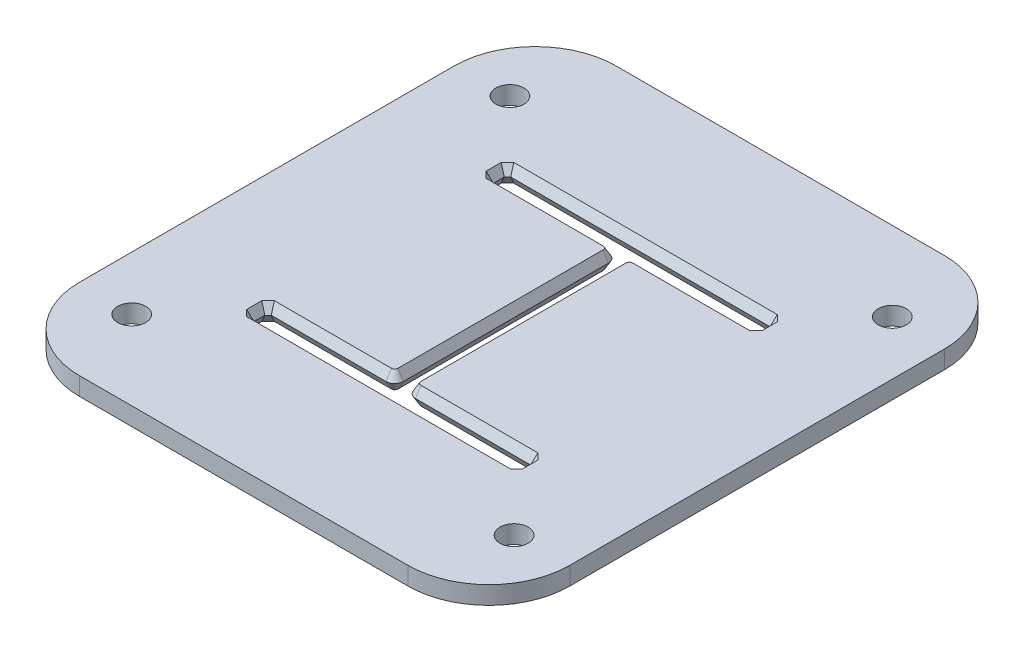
ISO-10303-21;
HEADER;
FILE_DESCRIPTION(('STEP AP214'),'2;1');
FILE_NAME('part.step','',(''),(''),'','','');
FILE_SCHEMA(('AUTOMOTIVE_DESIGN { 1 0 10303 214 1 1 1 1 }'));
ENDSEC;
DATA;
#1=APPLICATION_CONTEXT('core data for automotive mechanical design processes');
#2=APPLICATION_PROTOCOL_DEFINITION('international standard','automotive_design',2000,#1);
#3=PRODUCT_CONTEXT('',#1,'mechanical');
#4=PRODUCT('Part','Part','',(#3));
#5=PRODUCT_RELATED_PRODUCT_CATEGORY('part','',(#4));
#6=PRODUCT_DEFINITION_FORMATION('','',#4);
#7=PRODUCT_DEFINITION_CONTEXT('part definition',#1,'design');
#8=PRODUCT_DEFINITION('design','',#6,#7);
#9=PRODUCT_DEFINITION_SHAPE('','',#8);
#10=(LENGTH_UNIT() NAMED_UNIT(*) SI_UNIT(.MILLI.,.METRE.));
#11=(NAMED_UNIT(*) PLANE_ANGLE_UNIT() SI_UNIT($,.RADIAN.));
#12=(NAMED_UNIT(*) SI_UNIT($,.STERADIAN.) SOLID_ANGLE_UNIT());
#13=UNCERTAINTY_MEASURE_WITH_UNIT(LENGTH_MEASURE(1.E-05),#10,'distance_accuracy_value','');
#14=(GEOMETRIC_REPRESENTATION_CONTEXT(3) GLOBAL_UNCERTAINTY_ASSIGNED_CONTEXT((#13)) GLOBAL_UNIT_ASSIGNED_CONTEXT((#10,
#11,#12)) REPRESENTATION_CONTEXT('',''));
#15=CARTESIAN_POINT('',(0.,0.,0.));
#16=DIRECTION('',(0.,0.,1.));
#17=DIRECTION('',(1.,0.,0.));
#18=AXIS2_PLACEMENT_3D('',#15,#16,#17);
#19=CARTESIAN_POINT('',(0.,12.7,0.));
#20=DIRECTION('',(0.,1.,0.));
#21=DIRECTION('',(0.,0.,1.));
#22=AXIS2_PLACEMENT_3D('',#19,#20,#21);
#23=PLANE('',#22);
#24=DIRECTION('',(0.707106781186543,0.,0.707106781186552));
#25=VECTOR('',#24,1.);
#26=CARTESIAN_POINT('',(-18.2747789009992,12.7,18.274778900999));
#27=LINE('',#26,#25);
#28=CARTESIAN_POINT('',(-186.062209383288,12.7,-149.512651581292));
#29=VERTEX_POINT('',#28);
#30=CARTESIAN_POINT('',(-194.911348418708,12.7,-158.361790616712));
#31=VERTEX_POINT('',#30);
#32=EDGE_CURVE('E45',#29,#31,#27,.F.);
#33=ORIENTED_EDGE('',*,*,#32,.T.);
#34=DIRECTION('',(0.,0.,1.));
#35=VECTOR('',#34,1.);
#36=CARTESIAN_POINT('',(-194.911348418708,12.7,0.));
#37=LINE('',#36,#35);
#38=CARTESIAN_POINT('',(-194.911348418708,12.7,-179.712209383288));
#39=VERTEX_POINT('',#38);
#40=EDGE_CURVE('E11',#31,#39,#37,.F.);
#41=ORIENTED_EDGE('',*,*,#40,.T.);
#42=DIRECTION('',(-0.707106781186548,0.,0.707106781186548));
#43=VECTOR('',#42,1.);
#44=CARTESIAN_POINT('',(-187.311778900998,12.7,-187.311778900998));
#45=LINE('',#44,#43);
#46=CARTESIAN_POINT('',(-186.062209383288,12.7,-188.561348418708));
#47=VERTEX_POINT('',#46);
#48=EDGE_CURVE('E672',#39,#47,#45,.F.);
#49=ORIENTED_EDGE('',*,*,#48,.T.);
#50=DIRECTION('',(-1.,0.,0.));
#51=VECTOR('',#50,1.);
#52=CARTESIAN_POINT('',(0.,12.7,-188.561348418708));
#53=LINE('',#52,#51);
#54=CARTESIAN_POINT('',(186.062209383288,12.7,-188.561348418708));
#55=VERTEX_POINT('',#54);
#56=EDGE_CURVE('E675',#47,#55,#53,.F.);
#57=ORIENTED_EDGE('',*,*,#56,.T.);
#58=DIRECTION('',(-0.707106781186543,0.,-0.707106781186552));
#59=VECTOR('',#58,1.);
#60=CARTESIAN_POINT('',(187.311778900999,12.7,-187.311778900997));
#61=LINE('',#60,#59);
#62=CARTESIAN_POINT('',(194.911348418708,12.7,-179.712209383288));
#63=VERTEX_POINT('',#62);
#64=EDGE_CURVE('E678',#55,#63,#61,.F.);
#65=ORIENTED_EDGE('',*,*,#64,.T.);
#66=DIRECTION('',(0.,0.,-1.));
#67=VECTOR('',#66,1.);
#68=CARTESIAN_POINT('',(194.91134841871,12.7,-1.41655941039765E-12));
#69=LINE('',#68,#67);
#70=CARTESIAN_POINT('',(194.911348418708,12.7,-158.361790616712));
#71=VERTEX_POINT('',#70);
#72=EDGE_CURVE('E681',#63,#71,#69,.F.);
#73=ORIENTED_EDGE('',*,*,#72,.T.);
#74=DIRECTION('',(0.707106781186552,0.,-0.707106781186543));
#75=VECTOR('',#74,1.);
#76=CARTESIAN_POINT('',(18.2747789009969,12.7,18.2747789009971));
#77=LINE('',#76,#75);
#78=CARTESIAN_POINT('',(186.062209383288,12.7,-149.512651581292));
#79=VERTEX_POINT('',#78);
#80=EDGE_CURVE('E684',#71,#79,#77,.F.);
#81=ORIENTED_EDGE('',*,*,#80,.T.);
#82=DIRECTION('',(1.,0.,0.));
#83=VECTOR('',#82,1.);
#84=CARTESIAN_POINT('',(0.,12.7,-149.512651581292));
#85=LINE('',#84,#83);
#86=CARTESIAN_POINT('',(20.828,12.7,-149.512651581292));
#87=VERTEX_POINT('',#86);
#88=EDGE_CURVE('E687',#79,#87,#85,.F.);
#89=ORIENTED_EDGE('',*,*,#88,.T.);
#90=CARTESIAN_POINT('',(20.828,12.7,-144.78));
#91=DIRECTION('',(0.,1.,0.));
#92=DIRECTION('',(0.,0.,1.));
#93=AXIS2_PLACEMENT_3D('',#90,#91,#92);
#94=CIRCLE('',#93,4.73265158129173);
#95=CARTESIAN_POINT('',(16.0953484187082,12.7,-144.78));
#96=VERTEX_POINT('',#95);
#97=EDGE_CURVE('E690',#87,#96,#94,.T.);
#98=ORIENTED_EDGE('',*,*,#97,.T.);
#99=DIRECTION('',(0.,0.,-1.));
#100=VECTOR('',#99,1.);
#101=CARTESIAN_POINT('',(16.0953484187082,12.7,0.));
#102=LINE('',#101,#100);
#103=CARTESIAN_POINT('',(16.0953484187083,12.7,144.78));
#104=VERTEX_POINT('',#103);
#105=EDGE_CURVE('E693',#96,#104,#102,.F.);
#106=ORIENTED_EDGE('',*,*,#105,.T.);
#107=CARTESIAN_POINT('',(20.8280000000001,12.7,144.78));
#108=DIRECTION('',(0.,1.,0.));
#109=DIRECTION('',(0.,0.,1.));
#110=AXIS2_PLACEMENT_3D('',#107,#108,#109);
#111=CIRCLE('',#110,4.73265158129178);
#112=CARTESIAN_POINT('',(20.8280000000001,12.7,149.512651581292));
#113=VERTEX_POINT('',#112);
#114=EDGE_CURVE('E696',#104,#113,#111,.T.);
#115=ORIENTED_EDGE('',*,*,#114,.T.);
#116=DIRECTION('',(-1.,0.,0.));
#117=VECTOR('',#116,1.);
#118=CARTESIAN_POINT('',(0.,12.7,149.512651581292));
#119=LINE('',#118,#117);
#120=CARTESIAN_POINT('',(186.062209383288,12.7,149.512651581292));
#121=VERTEX_POINT('',#120);
#122=EDGE_CURVE('E699',#113,#121,#119,.F.);
#123=ORIENTED_EDGE('',*,*,#122,.T.);
#124=DIRECTION('',(-0.707106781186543,0.,-0.707106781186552));
#125=VECTOR('',#124,1.);
#126=CARTESIAN_POINT('',(18.274778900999,12.7,-18.2747789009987));
#127=LINE('',#126,#125);
#128=CARTESIAN_POINT('',(194.911348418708,12.7,158.361790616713));
#129=VERTEX_POINT('',#128);
#130=EDGE_CURVE('E702',#121,#129,#127,.F.);
#131=ORIENTED_EDGE('',*,*,#130,.T.);
#132=DIRECTION('',(0.,0.,-1.));
#133=VECTOR('',#132,1.);
#134=CARTESIAN_POINT('',(194.911348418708,12.7,0.));
#135=LINE('',#134,#133);
#136=CARTESIAN_POINT('',(194.911348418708,12.7,179.712209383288));
#137=VERTEX_POINT('',#136);
#138=EDGE_CURVE('E705',#129,#137,#135,.F.);
#139=ORIENTED_EDGE('',*,*,#138,.T.);
#140=DIRECTION('',(0.707106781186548,0.,-0.707106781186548));
#141=VECTOR('',#140,1.);
#142=CARTESIAN_POINT('',(187.311778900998,12.7,187.311778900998));
#143=LINE('',#142,#141);
#144=CARTESIAN_POINT('',(186.062209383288,12.7,188.561348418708));
#145=VERTEX_POINT('',#144);
#146=EDGE_CURVE('E708',#137,#145,#143,.F.);
#147=ORIENTED_EDGE('',*,*,#146,.T.);
#148=DIRECTION('',(1.,0.,0.));
#149=VECTOR('',#148,1.);
#150=CARTESIAN_POINT('',(0.,12.7,188.561348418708));
#151=LINE('',#150,#149);
#152=CARTESIAN_POINT('',(-186.062209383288,12.7,188.561348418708));
#153=VERTEX_POINT('',#152);
#154=EDGE_CURVE('E711',#145,#153,#151,.F.);
#155=ORIENTED_EDGE('',*,*,#154,.T.);
#156=DIRECTION('',(0.707106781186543,0.,0.707106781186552));
#157=VECTOR('',#156,1.);
#158=CARTESIAN_POINT('',(-187.311778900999,12.7,187.311778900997));
#159=LINE('',#158,#157);
#160=CARTESIAN_POINT('',(-194.911348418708,12.7,179.712209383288));
#161=VERTEX_POINT('',#160);
#162=EDGE_CURVE('E714',#153,#161,#159,.F.);
#163=ORIENTED_EDGE('',*,*,#162,.T.);
#164=DIRECTION('',(0.,0.,1.));
#165=VECTOR('',#164,1.);
#166=CARTESIAN_POINT('',(-194.911348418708,12.7,0.));
#167=LINE('',#166,#165);
#168=CARTESIAN_POINT('',(-194.911348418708,12.7,158.361790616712));
#169=VERTEX_POINT('',#168);
#170=EDGE_CURVE('E717',#161,#169,#167,.F.);
#171=ORIENTED_EDGE('',*,*,#170,.T.);
#172=DIRECTION('',(-0.707106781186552,0.,0.707106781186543));
#173=VECTOR('',#172,1.);
#174=CARTESIAN_POINT('',(-18.2747789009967,12.7,-18.2747789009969));
#175=LINE('',#174,#173);
#176=CARTESIAN_POINT('',(-186.062209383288,12.7,149.512651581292));
#177=VERTEX_POINT('',#176);
#178=EDGE_CURVE('E720',#169,#177,#175,.F.);
#179=ORIENTED_EDGE('',*,*,#178,.T.);
#180=DIRECTION('',(-1.,0.,0.));
#181=VECTOR('',#180,1.);
#182=CARTESIAN_POINT('',(0.,12.7,149.512651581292));
#183=LINE('',#182,#181);
#184=CARTESIAN_POINT('',(-20.828,12.7,149.512651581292));
#185=VERTEX_POINT('',#184);
#186=EDGE_CURVE('E723',#177,#185,#183,.F.);
#187=ORIENTED_EDGE('',*,*,#186,.T.);
#188=CARTESIAN_POINT('',(-20.828,12.7,144.78));
#189=DIRECTION('',(0.,1.,0.));
#190=DIRECTION('',(0.,0.,1.));
#191=AXIS2_PLACEMENT_3D('',#188,#189,#190);
#192=CIRCLE('',#191,4.73265158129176);
#193=CARTESIAN_POINT('',(-16.0953484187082,12.7,144.78));
#194=VERTEX_POINT('',#193);
#195=EDGE_CURVE('E726',#185,#194,#192,.T.);
#196=ORIENTED_EDGE('',*,*,#195,.T.);
#197=DIRECTION('',(0.,0.,1.));
#198=VECTOR('',#197,1.);
#199=CARTESIAN_POINT('',(-16.0953484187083,12.7,0.));
#200=LINE('',#199,#198);
#201=CARTESIAN_POINT('',(-16.0953484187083,12.7,-144.78));
#202=VERTEX_POINT('',#201);
#203=EDGE_CURVE('E729',#194,#202,#200,.F.);
#204=ORIENTED_EDGE('',*,*,#203,.T.);
#205=CARTESIAN_POINT('',(-20.8280000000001,12.7,-144.78));
#206=DIRECTION('',(0.,1.,0.));
#207=DIRECTION('',(0.,0.,1.));
#208=AXIS2_PLACEMENT_3D('',#205,#206,#207);
#209=CIRCLE('',#208,4.73265158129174);
#210=CARTESIAN_POINT('',(-20.8280000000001,12.7,-149.512651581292));
#211=VERTEX_POINT('',#210);
#212=EDGE_CURVE('E732',#202,#211,#209,.T.);
#213=ORIENTED_EDGE('',*,*,#212,.T.);
#214=DIRECTION('',(1.,0.,0.));
#215=VECTOR('',#214,1.);
#216=CARTESIAN_POINT('',(0.,12.7,-149.512651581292));
#217=LINE('',#216,#215);
#218=EDGE_CURVE('E735',#211,#29,#217,.F.);
#219=ORIENTED_EDGE('',*,*,#218,.T.);
#220=EDGE_LOOP('',(#33,#41,#49,#57,#65,#73,#81,#89,#98,#106,#115,#123,#131,#139,#147,#155,#163,
#171,#179,#187,#196,#204,#213,#219));
#221=FACE_BOUND('',#220,.T.);
#222=CARTESIAN_POINT('',(-269.922207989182,12.7,-267.001207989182));
#223=DIRECTION('',(0.,1.,0.));
#224=DIRECTION('',(0.,0.,1.));
#225=AXIS2_PLACEMENT_3D('',#222,#223,#224);
#226=CIRCLE('',#225,19.84375);
#227=CARTESIAN_POINT('',(-269.922207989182,12.7,-247.157457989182));
#228=VERTEX_POINT('',#227);
#229=EDGE_CURVE('E398',#228,#228,#226,.T.);
#230=ORIENTED_EDGE('',*,*,#229,.F.);
#231=EDGE_LOOP('',(#230));
#232=FACE_BOUND('',#231,.T.);
#233=CARTESIAN_POINT('',(269.922207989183,12.7,267.001207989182));
#234=DIRECTION('',(0.,1.,0.));
#235=DIRECTION('',(0.,0.,1.));
#236=AXIS2_PLACEMENT_3D('',#233,#234,#235);
#237=CIRCLE('',#236,19.84375);
#238=CARTESIAN_POINT('',(269.922207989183,12.7,286.844957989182));
#239=VERTEX_POINT('',#238);
#240=EDGE_CURVE('E373',#239,#239,#237,.T.);
#241=ORIENTED_EDGE('',*,*,#240,.F.);
#242=EDGE_LOOP('',(#241));
#243=FACE_BOUND('',#242,.T.);
#244=CARTESIAN_POINT('',(-269.922207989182,12.7,267.001207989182));
#245=DIRECTION('',(0.,1.,0.));
#246=DIRECTION('',(0.,0.,1.));
#247=AXIS2_PLACEMENT_3D('',#244,#245,#246);
#248=CIRCLE('',#247,19.84375);
#249=CARTESIAN_POINT('',(-269.922207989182,12.7,286.844957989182));
#250=VERTEX_POINT('',#249);
#251=EDGE_CURVE('E390',#250,#250,#248,.T.);
#252=ORIENTED_EDGE('',*,*,#251,.F.);
#253=EDGE_LOOP('',(#252));
#254=FACE_BOUND('',#253,.T.);
#255=CARTESIAN_POINT('',(269.922207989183,12.7,-267.001207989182));
#256=DIRECTION('',(0.,1.,0.));
#257=DIRECTION('',(0.,0.,1.));
#258=AXIS2_PLACEMENT_3D('',#255,#256,#257);
#259=CIRCLE('',#258,19.84375);
#260=CARTESIAN_POINT('',(269.922207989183,12.7,-247.157457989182));
#261=VERTEX_POINT('',#260);
#262=EDGE_CURVE('E391',#261,#261,#259,.T.);
#263=ORIENTED_EDGE('',*,*,#262,.F.);
#264=EDGE_LOOP('',(#263));
#265=FACE_BOUND('',#264,.T.);
#266=DIRECTION('',(0.,0.,1.));
#267=VECTOR('',#266,1.);
#268=CARTESIAN_POINT('',(-346.122207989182,12.7,-264.461207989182));
#269=LINE('',#268,#267);
#270=CARTESIAN_POINT('',(-346.122207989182,12.7,-264.461207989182));
#271=VERTEX_POINT('',#270);
#272=CARTESIAN_POINT('',(-346.122207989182,12.7,264.461207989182));
#273=VERTEX_POINT('',#272);
#274=EDGE_CURVE('E335',#271,#273,#269,.T.);
#275=ORIENTED_EDGE('',*,*,#274,.T.);
#276=CARTESIAN_POINT('',(-231.822207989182,12.7,264.461207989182));
#277=DIRECTION('',(0.,1.,0.));
#278=DIRECTION('',(0.,0.,-1.));
#279=AXIS2_PLACEMENT_3D('',#276,#277,#278);
#280=CIRCLE('',#279,114.3);
#281=CARTESIAN_POINT('',(-231.822207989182,12.7,378.761207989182));
#282=VERTEX_POINT('',#281);
#283=EDGE_CURVE('E320',#273,#282,#280,.T.);
#284=ORIENTED_EDGE('',*,*,#283,.T.);
#285=DIRECTION('',(1.,0.,0.));
#286=VECTOR('',#285,1.);
#287=CARTESIAN_POINT('',(-231.822207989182,12.7,378.761207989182));
#288=LINE('',#287,#286);
#289=CARTESIAN_POINT('',(231.822207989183,12.7,378.761207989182));
#290=VERTEX_POINT('',#289);
#291=EDGE_CURVE('E329',#282,#290,#288,.T.);
#292=ORIENTED_EDGE('',*,*,#291,.T.);
#293=CARTESIAN_POINT('',(231.822207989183,12.7,264.461207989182));
#294=DIRECTION('',(0.,1.,0.));
#295=DIRECTION('',(0.,0.,1.));
#296=AXIS2_PLACEMENT_3D('',#293,#294,#295);
#297=CIRCLE('',#296,114.3);
#298=CARTESIAN_POINT('',(346.122207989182,12.7,264.461207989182));
#299=VERTEX_POINT('',#298);
#300=EDGE_CURVE('E52',#290,#299,#297,.T.);
#301=ORIENTED_EDGE('',*,*,#300,.T.);
#302=DIRECTION('',(0.,0.,-1.));
#303=VECTOR('',#302,1.);
#304=CARTESIAN_POINT('',(346.122207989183,12.7,-264.461207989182));
#305=LINE('',#304,#303);
#306=CARTESIAN_POINT('',(346.122207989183,12.7,-264.461207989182));
#307=VERTEX_POINT('',#306);
#308=EDGE_CURVE('E339',#299,#307,#305,.T.);
#309=ORIENTED_EDGE('',*,*,#308,.T.);
#310=CARTESIAN_POINT('',(231.822207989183,12.7,-264.461207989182));
#311=DIRECTION('',(0.,1.,0.));
#312=DIRECTION('',(0.,0.,-1.));
#313=AXIS2_PLACEMENT_3D('',#310,#311,#312);
#314=CIRCLE('',#313,114.3);
#315=CARTESIAN_POINT('',(231.822207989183,12.7,-378.761207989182));
#316=VERTEX_POINT('',#315);
#317=EDGE_CURVE('E342',#307,#316,#314,.T.);
#318=ORIENTED_EDGE('',*,*,#317,.T.);
#319=DIRECTION('',(-1.,0.,0.));
#320=VECTOR('',#319,1.);
#321=CARTESIAN_POINT('',(-231.822207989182,12.7,-378.761207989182));
#322=LINE('',#321,#320);
#323=CARTESIAN_POINT('',(-231.822207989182,12.7,-378.761207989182));
#324=VERTEX_POINT('',#323);
#325=EDGE_CURVE('E345',#316,#324,#322,.T.);
#326=ORIENTED_EDGE('',*,*,#325,.T.);
#327=CARTESIAN_POINT('',(-231.822207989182,12.7,-264.461207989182));
#328=DIRECTION('',(0.,1.,0.));
#329=DIRECTION('',(0.,0.,-1.));
#330=AXIS2_PLACEMENT_3D('',#327,#328,#329);
#331=CIRCLE('',#330,114.3);
#332=EDGE_CURVE('E348',#324,#271,#331,.T.);
#333=ORIENTED_EDGE('',*,*,#332,.T.);
#334=EDGE_LOOP('',(#275,#284,#292,#301,#309,#318,#326,#333));
#335=FACE_BOUND('',#334,.T.);
#336=ADVANCED_FACE('F37',(#221,#232,#243,#254,#265,#335),#23,.T.);
#337=CARTESIAN_POINT('',(0.,-12.7,0.));
#338=DIRECTION('',(0.,1.,0.));
#339=DIRECTION('',(0.,0.,1.));
#340=AXIS2_PLACEMENT_3D('',#337,#338,#339);
#341=PLANE('',#340);
#342=DIRECTION('',(-0.707106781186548,0.,0.707106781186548));
#343=VECTOR('',#342,1.);
#344=CARTESIAN_POINT('',(-187.311778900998,-12.7,-187.311778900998));
#345=LINE('',#344,#343);
#346=CARTESIAN_POINT('',(-186.062209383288,-12.7,-188.561348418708));
#347=VERTEX_POINT('',#346);
#348=CARTESIAN_POINT('',(-194.911348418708,-12.7,-179.712209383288));
#349=VERTEX_POINT('',#348);
#350=EDGE_CURVE('E666',#347,#349,#345,.T.);
#351=ORIENTED_EDGE('',*,*,#350,.T.);
#352=DIRECTION('',(0.,0.,1.));
#353=VECTOR('',#352,1.);
#354=CARTESIAN_POINT('',(-194.911348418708,-12.7,0.));
#355=LINE('',#354,#353);
#356=CARTESIAN_POINT('',(-194.911348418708,-12.7,-158.361790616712));
#357=VERTEX_POINT('',#356);
#358=EDGE_CURVE('E669',#349,#357,#355,.T.);
#359=ORIENTED_EDGE('',*,*,#358,.T.);
#360=DIRECTION('',(0.707106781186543,0.,0.707106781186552));
#361=VECTOR('',#360,1.);
#362=CARTESIAN_POINT('',(-18.2747789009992,-12.7,18.274778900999));
#363=LINE('',#362,#361);
#364=CARTESIAN_POINT('',(-186.062209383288,-12.7,-149.512651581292));
#365=VERTEX_POINT('',#364);
#366=EDGE_CURVE('E555',#357,#365,#363,.T.);
#367=ORIENTED_EDGE('',*,*,#366,.T.);
#368=DIRECTION('',(1.,0.,0.));
#369=VECTOR('',#368,1.);
#370=CARTESIAN_POINT('',(0.,-12.7,-149.512651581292));
#371=LINE('',#370,#369);
#372=CARTESIAN_POINT('',(-20.8280000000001,-12.7,-149.512651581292));
#373=VERTEX_POINT('',#372);
#374=EDGE_CURVE('E603',#365,#373,#371,.T.);
#375=ORIENTED_EDGE('',*,*,#374,.T.);
#376=CARTESIAN_POINT('',(-20.8280000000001,-12.7,-144.78));
#377=DIRECTION('',(0.,1.,0.));
#378=DIRECTION('',(0.,0.,1.));
#379=AXIS2_PLACEMENT_3D('',#376,#377,#378);
#380=CIRCLE('',#379,4.73265158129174);
#381=CARTESIAN_POINT('',(-16.0953484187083,-12.7,-144.78));
#382=VERTEX_POINT('',#381);
#383=EDGE_CURVE('E606',#373,#382,#380,.F.);
#384=ORIENTED_EDGE('',*,*,#383,.T.);
#385=DIRECTION('',(0.,0.,1.));
#386=VECTOR('',#385,1.);
#387=CARTESIAN_POINT('',(-16.0953484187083,-12.7,0.));
#388=LINE('',#387,#386);
#389=CARTESIAN_POINT('',(-16.0953484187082,-12.7,144.78));
#390=VERTEX_POINT('',#389);
#391=EDGE_CURVE('E609',#382,#390,#388,.T.);
#392=ORIENTED_EDGE('',*,*,#391,.T.);
#393=CARTESIAN_POINT('',(-20.828,-12.7,144.78));
#394=DIRECTION('',(0.,1.,0.));
#395=DIRECTION('',(0.,0.,1.));
#396=AXIS2_PLACEMENT_3D('',#393,#394,#395);
#397=CIRCLE('',#396,4.73265158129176);
#398=CARTESIAN_POINT('',(-20.828,-12.7,149.512651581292));
#399=VERTEX_POINT('',#398);
#400=EDGE_CURVE('E612',#390,#399,#397,.F.);
#401=ORIENTED_EDGE('',*,*,#400,.T.);
#402=DIRECTION('',(-1.,0.,0.));
#403=VECTOR('',#402,1.);
#404=CARTESIAN_POINT('',(0.,-12.7,149.512651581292));
#405=LINE('',#404,#403);
#406=CARTESIAN_POINT('',(-186.062209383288,-12.7,149.512651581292));
#407=VERTEX_POINT('',#406);
#408=EDGE_CURVE('E615',#399,#407,#405,.T.);
#409=ORIENTED_EDGE('',*,*,#408,.T.);
#410=DIRECTION('',(-0.707106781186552,0.,0.707106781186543));
#411=VECTOR('',#410,1.);
#412=CARTESIAN_POINT('',(-18.2747789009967,-12.7,-18.2747789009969));
#413=LINE('',#412,#411);
#414=CARTESIAN_POINT('',(-194.911348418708,-12.7,158.361790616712));
#415=VERTEX_POINT('',#414);
#416=EDGE_CURVE('E618',#407,#415,#413,.T.);
#417=ORIENTED_EDGE('',*,*,#416,.T.);
#418=DIRECTION('',(0.,0.,1.));
#419=VECTOR('',#418,1.);
#420=CARTESIAN_POINT('',(-194.911348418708,-12.7,0.));
#421=LINE('',#420,#419);
#422=CARTESIAN_POINT('',(-194.911348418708,-12.7,179.712209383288));
#423=VERTEX_POINT('',#422);
#424=EDGE_CURVE('E621',#415,#423,#421,.T.);
#425=ORIENTED_EDGE('',*,*,#424,.T.);
#426=DIRECTION('',(0.707106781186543,0.,0.707106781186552));
#427=VECTOR('',#426,1.);
#428=CARTESIAN_POINT('',(-187.311778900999,-12.7,187.311778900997));
#429=LINE('',#428,#427);
#430=CARTESIAN_POINT('',(-186.062209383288,-12.7,188.561348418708));
#431=VERTEX_POINT('',#430);
#432=EDGE_CURVE('E624',#423,#431,#429,.T.);
#433=ORIENTED_EDGE('',*,*,#432,.T.);
#434=DIRECTION('',(1.,0.,0.));
#435=VECTOR('',#434,1.);
#436=CARTESIAN_POINT('',(0.,-12.7,188.561348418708));
#437=LINE('',#436,#435);
#438=CARTESIAN_POINT('',(186.062209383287,-12.7,188.561348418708));
#439=VERTEX_POINT('',#438);
#440=EDGE_CURVE('E627',#431,#439,#437,.T.);
#441=ORIENTED_EDGE('',*,*,#440,.T.);
#442=DIRECTION('',(0.707106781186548,0.,-0.707106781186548));
#443=VECTOR('',#442,1.);
#444=CARTESIAN_POINT('',(187.311778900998,-12.7,187.311778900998));
#445=LINE('',#444,#443);
#446=CARTESIAN_POINT('',(194.911348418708,-12.7,179.712209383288));
#447=VERTEX_POINT('',#446);
#448=EDGE_CURVE('E630',#439,#447,#445,.T.);
#449=ORIENTED_EDGE('',*,*,#448,.T.);
#450=DIRECTION('',(0.,0.,-1.));
#451=VECTOR('',#450,1.);
#452=CARTESIAN_POINT('',(194.911348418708,-12.7,0.));
#453=LINE('',#452,#451);
#454=CARTESIAN_POINT('',(194.911348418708,-12.7,158.361790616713));
#455=VERTEX_POINT('',#454);
#456=EDGE_CURVE('E633',#447,#455,#453,.T.);
#457=ORIENTED_EDGE('',*,*,#456,.T.);
#458=DIRECTION('',(-0.707106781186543,0.,-0.707106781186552));
#459=VECTOR('',#458,1.);
#460=CARTESIAN_POINT('',(18.274778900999,-12.7,-18.2747789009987));
#461=LINE('',#460,#459);
#462=CARTESIAN_POINT('',(186.062209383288,-12.7,149.512651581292));
#463=VERTEX_POINT('',#462);
#464=EDGE_CURVE('E636',#455,#463,#461,.T.);
#465=ORIENTED_EDGE('',*,*,#464,.T.);
#466=DIRECTION('',(-1.,0.,0.));
#467=VECTOR('',#466,1.);
#468=CARTESIAN_POINT('',(0.,-12.7,149.512651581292));
#469=LINE('',#468,#467);
#470=CARTESIAN_POINT('',(20.8280000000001,-12.7,149.512651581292));
#471=VERTEX_POINT('',#470);
#472=EDGE_CURVE('E639',#463,#471,#469,.T.);
#473=ORIENTED_EDGE('',*,*,#472,.T.);
#474=CARTESIAN_POINT('',(20.8280000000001,-12.7,144.78));
#475=DIRECTION('',(0.,1.,0.));
#476=DIRECTION('',(0.,0.,1.));
#477=AXIS2_PLACEMENT_3D('',#474,#475,#476);
#478=CIRCLE('',#477,4.73265158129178);
#479=CARTESIAN_POINT('',(16.0953484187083,-12.7,144.78));
#480=VERTEX_POINT('',#479);
#481=EDGE_CURVE('E642',#471,#480,#478,.F.);
#482=ORIENTED_EDGE('',*,*,#481,.T.);
#483=DIRECTION('',(0.,0.,-1.));
#484=VECTOR('',#483,1.);
#485=CARTESIAN_POINT('',(16.0953484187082,-12.7,0.));
#486=LINE('',#485,#484);
#487=CARTESIAN_POINT('',(16.0953484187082,-12.7,-144.78));
#488=VERTEX_POINT('',#487);
#489=EDGE_CURVE('E645',#480,#488,#486,.T.);
#490=ORIENTED_EDGE('',*,*,#489,.T.);
#491=CARTESIAN_POINT('',(20.828,-12.7,-144.78));
#492=DIRECTION('',(0.,1.,0.));
#493=DIRECTION('',(0.,0.,1.));
#494=AXIS2_PLACEMENT_3D('',#491,#492,#493);
#495=CIRCLE('',#494,4.73265158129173);
#496=CARTESIAN_POINT('',(20.828,-12.7,-149.512651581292));
#497=VERTEX_POINT('',#496);
#498=EDGE_CURVE('E648',#488,#497,#495,.F.);
#499=ORIENTED_EDGE('',*,*,#498,.T.);
#500=DIRECTION('',(1.,0.,0.));
#501=VECTOR('',#500,1.);
#502=CARTESIAN_POINT('',(0.,-12.7,-149.512651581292));
#503=LINE('',#502,#501);
#504=CARTESIAN_POINT('',(186.062209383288,-12.7,-149.512651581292));
#505=VERTEX_POINT('',#504);
#506=EDGE_CURVE('E651',#497,#505,#503,.T.);
#507=ORIENTED_EDGE('',*,*,#506,.T.);
#508=DIRECTION('',(0.707106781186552,0.,-0.707106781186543));
#509=VECTOR('',#508,1.);
#510=CARTESIAN_POINT('',(18.2747789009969,-12.7,18.2747789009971));
#511=LINE('',#510,#509);
#512=CARTESIAN_POINT('',(194.911348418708,-12.7,-158.361790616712));
#513=VERTEX_POINT('',#512);
#514=EDGE_CURVE('E654',#505,#513,#511,.T.);
#515=ORIENTED_EDGE('',*,*,#514,.T.);
#516=DIRECTION('',(0.,0.,-1.));
#517=VECTOR('',#516,1.);
#518=CARTESIAN_POINT('',(194.91134841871,-12.7,-1.41655941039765E-12));
#519=LINE('',#518,#517);
#520=CARTESIAN_POINT('',(194.911348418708,-12.7,-179.712209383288));
#521=VERTEX_POINT('',#520);
#522=EDGE_CURVE('E657',#513,#521,#519,.T.);
#523=ORIENTED_EDGE('',*,*,#522,.T.);
#524=DIRECTION('',(-0.707106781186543,0.,-0.707106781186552));
#525=VECTOR('',#524,1.);
#526=CARTESIAN_POINT('',(187.311778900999,-12.7,-187.311778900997));
#527=LINE('',#526,#525);
#528=CARTESIAN_POINT('',(186.062209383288,-12.7,-188.561348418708));
#529=VERTEX_POINT('',#528);
#530=EDGE_CURVE('E660',#521,#529,#527,.T.);
#531=ORIENTED_EDGE('',*,*,#530,.T.);
#532=DIRECTION('',(-1.,0.,0.));
#533=VECTOR('',#532,1.);
#534=CARTESIAN_POINT('',(0.,-12.7,-188.561348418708));
#535=LINE('',#534,#533);
#536=EDGE_CURVE('E663',#529,#347,#535,.T.);
#537=ORIENTED_EDGE('',*,*,#536,.T.);
#538=EDGE_LOOP('',(#351,#359,#367,#375,#384,#392,#401,#409,#417,#425,#433,#441,#449,#457,#465,
#473,#482,#490,#499,#507,#515,#523,#531,#537));
#539=FACE_BOUND('',#538,.T.);
#540=CARTESIAN_POINT('',(-269.922207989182,-12.7,-267.001207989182));
#541=DIRECTION('',(0.,1.,0.));
#542=DIRECTION('',(0.,0.,1.));
#543=AXIS2_PLACEMENT_3D('',#540,#541,#542);
#544=CIRCLE('',#543,19.84375);
#545=CARTESIAN_POINT('',(-269.922207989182,-12.7,-247.157457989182));
#546=VERTEX_POINT('',#545);
#547=EDGE_CURVE('E405',#546,#546,#544,.T.);
#548=ORIENTED_EDGE('',*,*,#547,.T.);
#549=EDGE_LOOP('',(#548));
#550=FACE_BOUND('',#549,.T.);
#551=CARTESIAN_POINT('',(269.922207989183,-12.7,267.001207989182));
#552=DIRECTION('',(0.,1.,0.));
#553=DIRECTION('',(0.,0.,1.));
#554=AXIS2_PLACEMENT_3D('',#551,#552,#553);
#555=CIRCLE('',#554,19.84375);
#556=CARTESIAN_POINT('',(269.922207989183,-12.7,286.844957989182));
#557=VERTEX_POINT('',#556);
#558=EDGE_CURVE('E387',#557,#557,#555,.T.);
#559=ORIENTED_EDGE('',*,*,#558,.T.);
#560=EDGE_LOOP('',(#559));
#561=FACE_BOUND('',#560,.T.);
#562=CARTESIAN_POINT('',(-269.922207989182,-12.7,267.001207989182));
#563=DIRECTION('',(0.,1.,0.));
#564=DIRECTION('',(0.,0.,1.));
#565=AXIS2_PLACEMENT_3D('',#562,#563,#564);
#566=CIRCLE('',#565,19.84375);
#567=CARTESIAN_POINT('',(-269.922207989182,-12.7,286.844957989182));
#568=VERTEX_POINT('',#567);
#569=EDGE_CURVE('E395',#568,#568,#566,.T.);
#570=ORIENTED_EDGE('',*,*,#569,.T.);
#571=EDGE_LOOP('',(#570));
#572=FACE_BOUND('',#571,.T.);
#573=CARTESIAN_POINT('',(269.922207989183,-12.7,-267.001207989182));
#574=DIRECTION('',(0.,1.,0.));
#575=DIRECTION('',(0.,0.,1.));
#576=AXIS2_PLACEMENT_3D('',#573,#574,#575);
#577=CIRCLE('',#576,19.84375);
#578=CARTESIAN_POINT('',(269.922207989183,-12.7,-247.157457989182));
#579=VERTEX_POINT('',#578);
#580=EDGE_CURVE('E394',#579,#579,#577,.T.);
#581=ORIENTED_EDGE('',*,*,#580,.T.);
#582=EDGE_LOOP('',(#581));
#583=FACE_BOUND('',#582,.T.);
#584=CARTESIAN_POINT('',(-231.822207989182,-12.7,264.461207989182));
#585=DIRECTION('',(0.,1.,0.));
#586=DIRECTION('',(0.,0.,-1.));
#587=AXIS2_PLACEMENT_3D('',#584,#585,#586);
#588=CIRCLE('',#587,114.3);
#589=CARTESIAN_POINT('',(-346.122207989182,-12.7,264.461207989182));
#590=VERTEX_POINT('',#589);
#591=CARTESIAN_POINT('',(-231.822207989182,-12.7,378.761207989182));
#592=VERTEX_POINT('',#591);
#593=EDGE_CURVE('E60',#590,#592,#588,.T.);
#594=ORIENTED_EDGE('',*,*,#593,.F.);
#595=DIRECTION('',(0.,0.,1.));
#596=VECTOR('',#595,1.);
#597=CARTESIAN_POINT('',(-346.122207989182,-12.7,-264.461207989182));
#598=LINE('',#597,#596);
#599=CARTESIAN_POINT('',(-346.122207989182,-12.7,-264.461207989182));
#600=VERTEX_POINT('',#599);
#601=EDGE_CURVE('E326',#600,#590,#598,.T.);
#602=ORIENTED_EDGE('',*,*,#601,.F.);
#603=CARTESIAN_POINT('',(-231.822207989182,-12.7,-264.461207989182));
#604=DIRECTION('',(0.,1.,0.));
#605=DIRECTION('',(0.,0.,-1.));
#606=AXIS2_PLACEMENT_3D('',#603,#604,#605);
#607=CIRCLE('',#606,114.3);
#608=CARTESIAN_POINT('',(-231.822207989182,-12.7,-378.761207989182));
#609=VERTEX_POINT('',#608);
#610=EDGE_CURVE('E366',#609,#600,#607,.T.);
#611=ORIENTED_EDGE('',*,*,#610,.F.);
#612=DIRECTION('',(-1.,0.,0.));
#613=VECTOR('',#612,1.);
#614=CARTESIAN_POINT('',(-231.822207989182,-12.7,-378.761207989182));
#615=LINE('',#614,#613);
#616=CARTESIAN_POINT('',(231.822207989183,-12.7,-378.761207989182));
#617=VERTEX_POINT('',#616);
#618=EDGE_CURVE('E363',#617,#609,#615,.T.);
#619=ORIENTED_EDGE('',*,*,#618,.F.);
#620=CARTESIAN_POINT('',(231.822207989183,-12.7,-264.461207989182));
#621=DIRECTION('',(0.,1.,0.));
#622=DIRECTION('',(0.,0.,-1.));
#623=AXIS2_PLACEMENT_3D('',#620,#621,#622);
#624=CIRCLE('',#623,114.3);
#625=CARTESIAN_POINT('',(346.122207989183,-12.7,-264.461207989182));
#626=VERTEX_POINT('',#625);
#627=EDGE_CURVE('E360',#626,#617,#624,.T.);
#628=ORIENTED_EDGE('',*,*,#627,.F.);
#629=DIRECTION('',(0.,0.,-1.));
#630=VECTOR('',#629,1.);
#631=CARTESIAN_POINT('',(346.122207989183,-12.7,-264.461207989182));
#632=LINE('',#631,#630);
#633=CARTESIAN_POINT('',(346.122207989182,-12.7,264.461207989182));
#634=VERTEX_POINT('',#633);
#635=EDGE_CURVE('E357',#634,#626,#632,.T.);
#636=ORIENTED_EDGE('',*,*,#635,.F.);
#637=CARTESIAN_POINT('',(231.822207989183,-12.7,264.461207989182));
#638=DIRECTION('',(0.,1.,0.));
#639=DIRECTION('',(0.,0.,1.));
#640=AXIS2_PLACEMENT_3D('',#637,#638,#639);
#641=CIRCLE('',#640,114.3);
#642=CARTESIAN_POINT('',(231.822207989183,-12.7,378.761207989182));
#643=VERTEX_POINT('',#642);
#644=EDGE_CURVE('E354',#643,#634,#641,.T.);
#645=ORIENTED_EDGE('',*,*,#644,.F.);
#646=DIRECTION('',(1.,0.,0.));
#647=VECTOR('',#646,1.);
#648=CARTESIAN_POINT('',(-231.822207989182,-12.7,378.761207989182));
#649=LINE('',#648,#647);
#650=EDGE_CURVE('E352',#592,#643,#649,.T.);
#651=ORIENTED_EDGE('',*,*,#650,.F.);
#652=EDGE_LOOP('',(#594,#602,#611,#619,#628,#636,#645,#651));
#653=FACE_BOUND('',#652,.T.);
#654=ADVANCED_FACE('F39',(#539,#550,#561,#572,#583,#653),#341,.F.);
#655=CARTESIAN_POINT('',(-187.579,0.,-176.675051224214));
#656=DIRECTION('',(-0.866025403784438,0.500000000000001,0.));
#657=DIRECTION('',(-0.500000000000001,-0.866025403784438,0.));
#658=AXIS2_PLACEMENT_3D('',#655,#656,#657);
#659=PLANE('',#658);
#660=DIRECTION('',(0.489609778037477,0.848029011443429,0.202803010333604));
#661=VECTOR('',#660,1.);
#662=CARTESIAN_POINT('',(-187.579,0.,-176.675051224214));
#663=LINE('',#662,#661);
#664=CARTESIAN_POINT('',(-187.579,0.,-176.675051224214));
#665=VERTEX_POINT('',#664);
#666=EDGE_CURVE('E409',#349,#665,#663,.T.);
#667=ORIENTED_EDGE('',*,*,#666,.T.);
#668=DIRECTION('',(0.,0.,1.));
#669=VECTOR('',#668,1.);
#670=CARTESIAN_POINT('',(-187.579,0.,-176.675051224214));
#671=LINE('',#670,#669);
#672=CARTESIAN_POINT('',(-187.579,0.,-161.398948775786));
#673=VERTEX_POINT('',#672);
#674=EDGE_CURVE('E412',#665,#673,#671,.T.);
#675=ORIENTED_EDGE('',*,*,#674,.T.);
#676=DIRECTION('',(0.489609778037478,0.84802901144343,-0.202803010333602));
#677=VECTOR('',#676,1.);
#678=CARTESIAN_POINT('',(-186.062169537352,2.62722742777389,-162.027240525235));
#679=LINE('',#678,#677);
#680=EDGE_CURVE('E408',#357,#673,#679,.T.);
#681=ORIENTED_EDGE('',*,*,#680,.F.);
#682=ORIENTED_EDGE('',*,*,#358,.F.);
#683=EDGE_LOOP('',(#667,#675,#681,#682));
#684=FACE_BOUND('',#683,.T.);
#685=ADVANCED_FACE('F757',(#684),#659,.F.);
#686=CARTESIAN_POINT('',(-187.579,0.,-176.675051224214));
#687=DIRECTION('',(-0.612372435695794,0.500000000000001,-0.612372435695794));
#688=DIRECTION('',(-0.707106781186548,0.,0.707106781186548));
#689=AXIS2_PLACEMENT_3D('',#686,#687,#688);
#690=PLANE('',#689);
#691=DIRECTION('',(0.202803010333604,0.848029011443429,0.489609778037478));
#692=VECTOR('',#691,1.);
#693=CARTESIAN_POINT('',(-167.96975423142,62.9543348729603,-144.882297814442));
#694=LINE('',#693,#692);
#695=CARTESIAN_POINT('',(-183.025051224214,0.,-181.229));
#696=VERTEX_POINT('',#695);
#697=EDGE_CURVE('E413',#347,#696,#694,.T.);
#698=ORIENTED_EDGE('',*,*,#697,.T.);
#699=DIRECTION('',(-0.707106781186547,0.,0.707106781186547));
#700=VECTOR('',#699,1.);
#701=CARTESIAN_POINT('',(-187.579,0.,-176.675051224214));
#702=LINE('',#701,#700);
#703=EDGE_CURVE('E549',#696,#665,#702,.T.);
#704=ORIENTED_EDGE('',*,*,#703,.T.);
#705=ORIENTED_EDGE('',*,*,#666,.F.);
#706=ORIENTED_EDGE('',*,*,#350,.F.);
#707=EDGE_LOOP('',(#698,#704,#705,#706));
#708=FACE_BOUND('',#707,.T.);
#709=ADVANCED_FACE('F764',(#708),#690,.F.);
#710=CARTESIAN_POINT('',(183.025051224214,0.,-181.229));
#711=DIRECTION('',(0.,0.500000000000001,-0.866025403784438));
#712=DIRECTION('',(0.,0.866025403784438,0.500000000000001));
#713=AXIS2_PLACEMENT_3D('',#710,#711,#712);
#714=PLANE('',#713);
#715=DIRECTION('',(-0.202803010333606,0.848029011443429,0.489609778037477));
#716=VECTOR('',#715,1.);
#717=CARTESIAN_POINT('',(183.025051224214,0.,-181.229));
#718=LINE('',#717,#716);
#719=CARTESIAN_POINT('',(183.025051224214,0.,-181.229));
#720=VERTEX_POINT('',#719);
#721=EDGE_CURVE('E456',#529,#720,#718,.T.);
#722=ORIENTED_EDGE('',*,*,#721,.T.);
#723=DIRECTION('',(-1.,0.,0.));
#724=VECTOR('',#723,1.);
#725=CARTESIAN_POINT('',(183.025051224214,0.,-181.229));
#726=LINE('',#725,#724);
#727=EDGE_CURVE('E546',#720,#696,#726,.T.);
#728=ORIENTED_EDGE('',*,*,#727,.T.);
#729=ORIENTED_EDGE('',*,*,#697,.F.);
#730=ORIENTED_EDGE('',*,*,#536,.F.);
#731=EDGE_LOOP('',(#722,#728,#729,#730));
#732=FACE_BOUND('',#731,.T.);
#733=ADVANCED_FACE('F771',(#732),#714,.F.);
#734=CARTESIAN_POINT('',(183.025051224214,0.,-181.229));
#735=DIRECTION('',(0.612372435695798,0.500000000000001,-0.61237243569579));
#736=DIRECTION('',(-0.707106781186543,0.,-0.707106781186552));
#737=AXIS2_PLACEMENT_3D('',#734,#735,#736);
#738=PLANE('',#737);
#739=DIRECTION('',(-0.489609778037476,0.84802901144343,0.202803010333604));
#740=VECTOR('',#739,1.);
#741=CARTESIAN_POINT('',(186.062169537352,2.62722742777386,-176.046759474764));
#742=LINE('',#741,#740);
#743=CARTESIAN_POINT('',(187.579,0.,-176.675051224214));
#744=VERTEX_POINT('',#743);
#745=EDGE_CURVE('E453',#521,#744,#742,.T.);
#746=ORIENTED_EDGE('',*,*,#745,.T.);
#747=DIRECTION('',(-0.707106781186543,0.,-0.707106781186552));
#748=VECTOR('',#747,1.);
#749=CARTESIAN_POINT('',(183.025051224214,0.,-181.229));
#750=LINE('',#749,#748);
#751=EDGE_CURVE('E543',#744,#720,#750,.T.);
#752=ORIENTED_EDGE('',*,*,#751,.T.);
#753=ORIENTED_EDGE('',*,*,#721,.F.);
#754=ORIENTED_EDGE('',*,*,#530,.F.);
#755=EDGE_LOOP('',(#746,#752,#753,#754));
#756=FACE_BOUND('',#755,.T.);
#757=ADVANCED_FACE('F778',(#756),#738,.F.);
#758=CARTESIAN_POINT('',(187.579,0.,-161.398948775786));
#759=DIRECTION('',(0.866025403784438,0.500000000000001,0.));
#760=DIRECTION('',(-0.500000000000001,0.866025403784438,0.));
#761=AXIS2_PLACEMENT_3D('',#758,#759,#760);
#762=PLANE('',#761);
#763=DIRECTION('',(-0.489609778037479,0.848029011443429,-0.202803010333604));
#764=VECTOR('',#763,1.);
#765=CARTESIAN_POINT('',(186.939519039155,1.10761351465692,-161.663830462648));
#766=LINE('',#765,#764);
#767=CARTESIAN_POINT('',(187.579,0.,-161.398948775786));
#768=VERTEX_POINT('',#767);
#769=EDGE_CURVE('E449',#513,#768,#766,.T.);
#770=ORIENTED_EDGE('',*,*,#769,.T.);
#771=DIRECTION('',(0.,0.,-1.));
#772=VECTOR('',#771,1.);
#773=CARTESIAN_POINT('',(187.579,0.,-161.398948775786));
#774=LINE('',#773,#772);
#775=EDGE_CURVE('E540',#768,#744,#774,.T.);
#776=ORIENTED_EDGE('',*,*,#775,.T.);
#777=ORIENTED_EDGE('',*,*,#745,.F.);
#778=ORIENTED_EDGE('',*,*,#522,.F.);
#779=EDGE_LOOP('',(#770,#776,#777,#778));
#780=FACE_BOUND('',#779,.T.);
#781=ADVANCED_FACE('F785',(#780),#762,.F.);
#782=CARTESIAN_POINT('',(183.025051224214,0.,-156.845));
#783=DIRECTION('',(0.61237243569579,0.500000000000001,0.612372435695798));
#784=DIRECTION('',(0.707106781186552,0.,-0.707106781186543));
#785=AXIS2_PLACEMENT_3D('',#782,#783,#784);
#786=PLANE('',#785);
#787=DIRECTION('',(-0.202803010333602,0.84802901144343,-0.489609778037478));
#788=VECTOR('',#787,1.);
#789=CARTESIAN_POINT('',(176.354038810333,27.8951089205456,-172.950248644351));
#790=LINE('',#789,#788);
#791=CARTESIAN_POINT('',(183.025051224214,0.,-156.845));
#792=VERTEX_POINT('',#791);
#793=EDGE_CURVE('E446',#505,#792,#790,.T.);
#794=ORIENTED_EDGE('',*,*,#793,.T.);
#795=DIRECTION('',(0.707106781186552,0.,-0.707106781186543));
#796=VECTOR('',#795,1.);
#797=CARTESIAN_POINT('',(183.025051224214,0.,-156.845));
#798=LINE('',#797,#796);
#799=EDGE_CURVE('E537',#792,#768,#798,.T.);
#800=ORIENTED_EDGE('',*,*,#799,.T.);
#801=ORIENTED_EDGE('',*,*,#769,.F.);
#802=ORIENTED_EDGE('',*,*,#514,.F.);
#803=EDGE_LOOP('',(#794,#800,#801,#802));
#804=FACE_BOUND('',#803,.T.);
#805=ADVANCED_FACE('F792',(#804),#786,.F.);
#806=CARTESIAN_POINT('',(20.828,0.,-156.845));
#807=DIRECTION('',(0.,0.500000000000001,0.866025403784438));
#808=DIRECTION('',(0.,-0.866025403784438,0.500000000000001));
#809=AXIS2_PLACEMENT_3D('',#806,#807,#808);
#810=PLANE('',#809);
#811=DIRECTION('',(0.,-0.866025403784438,0.500000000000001));
#812=VECTOR('',#811,1.);
#813=CARTESIAN_POINT('',(20.828,0.,-156.845));
#814=LINE('',#813,#812);
#815=CARTESIAN_POINT('',(20.828,0.,-156.845));
#816=VERTEX_POINT('',#815);
#817=EDGE_CURVE('E450',#497,#816,#814,.F.);
#818=ORIENTED_EDGE('',*,*,#817,.T.);
#819=DIRECTION('',(1.,0.,0.));
#820=VECTOR('',#819,1.);
#821=CARTESIAN_POINT('',(20.828,0.,-156.845));
#822=LINE('',#821,#820);
#823=EDGE_CURVE('E534',#816,#792,#822,.T.);
#824=ORIENTED_EDGE('',*,*,#823,.T.);
#825=ORIENTED_EDGE('',*,*,#793,.F.);
#826=ORIENTED_EDGE('',*,*,#506,.F.);
#827=EDGE_LOOP('',(#818,#824,#825,#826));
#828=FACE_BOUND('',#827,.T.);
#829=ADVANCED_FACE('F799',(#828),#810,.F.);
#830=CARTESIAN_POINT('',(20.828,0.,-144.78));
#831=DIRECTION('',(0.,1.,0.));
#832=DIRECTION('',(0.,0.,1.));
#833=AXIS2_PLACEMENT_3D('',#830,#831,#832);
#834=CONICAL_SURFACE('',#833,12.065,0.5235987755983);
#835=DIRECTION('',(0.500000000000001,-0.866025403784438,0.));
#836=VECTOR('',#835,1.);
#837=CARTESIAN_POINT('',(8.76299999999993,0.,-144.78));
#838=LINE('',#837,#836);
#839=CARTESIAN_POINT('',(8.76299999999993,0.,-144.78));
#840=VERTEX_POINT('',#839);
#841=EDGE_CURVE('E476',#488,#840,#838,.F.);
#842=ORIENTED_EDGE('',*,*,#841,.T.);
#843=CARTESIAN_POINT('',(20.828,0.,-144.78));
#844=DIRECTION('',(0.,-1.,0.));
#845=DIRECTION('',(0.,0.,1.));
#846=AXIS2_PLACEMENT_3D('',#843,#844,#845);
#847=CIRCLE('',#846,12.065);
#848=EDGE_CURVE('E531',#840,#816,#847,.T.);
#849=ORIENTED_EDGE('',*,*,#848,.T.);
#850=ORIENTED_EDGE('',*,*,#817,.F.);
#851=ORIENTED_EDGE('',*,*,#498,.F.);
#852=EDGE_LOOP('',(#842,#849,#850,#851));
#853=FACE_BOUND('',#852,.T.);
#854=ADVANCED_FACE('F806',(#853),#834,.T.);
#855=CARTESIAN_POINT('',(8.76300000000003,0.,144.78));
#856=DIRECTION('',(0.866025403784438,0.500000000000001,0.));
#857=DIRECTION('',(-0.500000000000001,0.866025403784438,0.));
#858=AXIS2_PLACEMENT_3D('',#855,#856,#857);
#859=PLANE('',#858);
#860=DIRECTION('',(0.500000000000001,-0.866025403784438,0.));
#861=VECTOR('',#860,1.);
#862=CARTESIAN_POINT('',(8.76300000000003,0.,144.78));
#863=LINE('',#862,#861);
#864=CARTESIAN_POINT('',(8.76300000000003,0.,144.78));
#865=VERTEX_POINT('',#864);
#866=EDGE_CURVE('E473',#480,#865,#863,.F.);
#867=ORIENTED_EDGE('',*,*,#866,.T.);
#868=DIRECTION('',(0.,0.,-1.));
#869=VECTOR('',#868,1.);
#870=CARTESIAN_POINT('',(8.76300000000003,0.,144.78));
#871=LINE('',#870,#869);
#872=EDGE_CURVE('E528',#865,#840,#871,.T.);
#873=ORIENTED_EDGE('',*,*,#872,.T.);
#874=ORIENTED_EDGE('',*,*,#841,.F.);
#875=ORIENTED_EDGE('',*,*,#489,.F.);
#876=EDGE_LOOP('',(#867,#873,#874,#875));
#877=FACE_BOUND('',#876,.T.);
#878=ADVANCED_FACE('F813',(#877),#859,.F.);
#879=CARTESIAN_POINT('',(20.8280000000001,0.,144.78));
#880=DIRECTION('',(0.,1.,0.));
#881=DIRECTION('',(0.,0.,1.));
#882=AXIS2_PLACEMENT_3D('',#879,#880,#881);
#883=CONICAL_SURFACE('',#882,12.065,0.5235987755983);
#884=DIRECTION('',(0.,-0.866025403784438,-0.500000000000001));
#885=VECTOR('',#884,1.);
#886=CARTESIAN_POINT('',(20.8280000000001,0.,156.845));
#887=LINE('',#886,#885);
#888=CARTESIAN_POINT('',(20.8280000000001,0.,156.845));
#889=VERTEX_POINT('',#888);
#890=EDGE_CURVE('E445',#471,#889,#887,.F.);
#891=ORIENTED_EDGE('',*,*,#890,.T.);
#892=CARTESIAN_POINT('',(20.8280000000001,0.,144.78));
#893=DIRECTION('',(0.,-1.,0.));
#894=DIRECTION('',(0.,0.,1.));
#895=AXIS2_PLACEMENT_3D('',#892,#893,#894);
#896=CIRCLE('',#895,12.065);
#897=EDGE_CURVE('E525',#889,#865,#896,.T.);
#898=ORIENTED_EDGE('',*,*,#897,.T.);
#899=ORIENTED_EDGE('',*,*,#866,.F.);
#900=ORIENTED_EDGE('',*,*,#481,.F.);
#901=EDGE_LOOP('',(#891,#898,#899,#900));
#902=FACE_BOUND('',#901,.T.);
#903=ADVANCED_FACE('F820',(#902),#883,.T.);
#904=CARTESIAN_POINT('',(183.025051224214,0.,156.845));
#905=DIRECTION('',(0.,0.500000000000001,-0.866025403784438));
#906=DIRECTION('',(0.,0.866025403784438,0.500000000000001));
#907=AXIS2_PLACEMENT_3D('',#904,#905,#906);
#908=PLANE('',#907);
#909=DIRECTION('',(-0.202803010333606,0.848029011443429,0.489609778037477));
#910=VECTOR('',#909,1.);
#911=CARTESIAN_POINT('',(183.025051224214,0.,156.845));
#912=LINE('',#911,#910);
#913=CARTESIAN_POINT('',(183.025051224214,0.,156.845));
#914=VERTEX_POINT('',#913);
#915=EDGE_CURVE('E442',#463,#914,#912,.T.);
#916=ORIENTED_EDGE('',*,*,#915,.T.);
#917=DIRECTION('',(-1.,0.,0.));
#918=VECTOR('',#917,1.);
#919=CARTESIAN_POINT('',(183.025051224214,0.,156.845));
#920=LINE('',#919,#918);
#921=EDGE_CURVE('E522',#914,#889,#920,.T.);
#922=ORIENTED_EDGE('',*,*,#921,.T.);
#923=ORIENTED_EDGE('',*,*,#890,.F.);
#924=ORIENTED_EDGE('',*,*,#472,.F.);
#925=EDGE_LOOP('',(#916,#922,#923,#924));
#926=FACE_BOUND('',#925,.T.);
#927=ADVANCED_FACE('F827',(#926),#908,.F.);
#928=CARTESIAN_POINT('',(183.025051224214,0.,156.845));
#929=DIRECTION('',(0.612372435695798,0.500000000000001,-0.61237243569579));
#930=DIRECTION('',(-0.707106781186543,0.,-0.707106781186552));
#931=AXIS2_PLACEMENT_3D('',#928,#929,#930);
#932=PLANE('',#931);
#933=DIRECTION('',(-0.489609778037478,0.84802901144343,0.202803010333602));
#934=VECTOR('',#933,1.);
#935=CARTESIAN_POINT('',(186.062169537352,2.62722742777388,162.027240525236));
#936=LINE('',#935,#934);
#937=CARTESIAN_POINT('',(187.579,0.,161.398948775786));
#938=VERTEX_POINT('',#937);
#939=EDGE_CURVE('E439',#455,#938,#936,.T.);
#940=ORIENTED_EDGE('',*,*,#939,.T.);
#941=DIRECTION('',(-0.707106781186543,0.,-0.707106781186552));
#942=VECTOR('',#941,1.);
#943=CARTESIAN_POINT('',(183.025051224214,0.,156.845));
#944=LINE('',#943,#942);
#945=EDGE_CURVE('E519',#938,#914,#944,.T.);
#946=ORIENTED_EDGE('',*,*,#945,.T.);
#947=ORIENTED_EDGE('',*,*,#915,.F.);
#948=ORIENTED_EDGE('',*,*,#464,.F.);
#949=EDGE_LOOP('',(#940,#946,#947,#948));
#950=FACE_BOUND('',#949,.T.);
#951=ADVANCED_FACE('F834',(#950),#932,.F.);
#952=CARTESIAN_POINT('',(187.579,0.,176.675051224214));
#953=DIRECTION('',(0.866025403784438,0.500000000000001,0.));
#954=DIRECTION('',(-0.500000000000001,0.866025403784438,0.));
#955=AXIS2_PLACEMENT_3D('',#952,#953,#954);
#956=PLANE('',#955);
#957=DIRECTION('',(-0.489609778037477,0.848029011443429,-0.202803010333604));
#958=VECTOR('',#957,1.);
#959=CARTESIAN_POINT('',(186.939519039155,1.10761351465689,176.410169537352));
#960=LINE('',#959,#958);
#961=CARTESIAN_POINT('',(187.579,0.,176.675051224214));
#962=VERTEX_POINT('',#961);
#963=EDGE_CURVE('E436',#447,#962,#960,.T.);
#964=ORIENTED_EDGE('',*,*,#963,.T.);
#965=DIRECTION('',(0.,0.,-1.));
#966=VECTOR('',#965,1.);
#967=CARTESIAN_POINT('',(187.579,0.,176.675051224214));
#968=LINE('',#967,#966);
#969=EDGE_CURVE('E516',#962,#938,#968,.T.);
#970=ORIENTED_EDGE('',*,*,#969,.T.);
#971=ORIENTED_EDGE('',*,*,#939,.F.);
#972=ORIENTED_EDGE('',*,*,#456,.F.);
#973=EDGE_LOOP('',(#964,#970,#971,#972));
#974=FACE_BOUND('',#973,.T.);
#975=ADVANCED_FACE('F841',(#974),#956,.F.);
#976=CARTESIAN_POINT('',(183.025051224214,0.,181.229));
#977=DIRECTION('',(0.612372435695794,0.500000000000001,0.612372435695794));
#978=DIRECTION('',(0.707106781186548,0.,-0.707106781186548));
#979=AXIS2_PLACEMENT_3D('',#976,#977,#978);
#980=PLANE('',#979);
#981=DIRECTION('',(-0.202803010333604,0.848029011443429,-0.489609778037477));
#982=VECTOR('',#981,1.);
#983=CARTESIAN_POINT('',(167.96975423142,62.9543348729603,144.882297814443));
#984=LINE('',#983,#982);
#985=CARTESIAN_POINT('',(183.025051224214,0.,181.229));
#986=VERTEX_POINT('',#985);
#987=EDGE_CURVE('E433',#439,#986,#984,.T.);
#988=ORIENTED_EDGE('',*,*,#987,.T.);
#989=DIRECTION('',(0.707106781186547,0.,-0.707106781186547));
#990=VECTOR('',#989,1.);
#991=CARTESIAN_POINT('',(183.025051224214,0.,181.229));
#992=LINE('',#991,#990);
#993=EDGE_CURVE('E513',#986,#962,#992,.T.);
#994=ORIENTED_EDGE('',*,*,#993,.T.);
#995=ORIENTED_EDGE('',*,*,#963,.F.);
#996=ORIENTED_EDGE('',*,*,#448,.F.);
#997=EDGE_LOOP('',(#988,#994,#995,#996));
#998=FACE_BOUND('',#997,.T.);
#999=ADVANCED_FACE('F848',(#998),#980,.F.);
#1000=CARTESIAN_POINT('',(-183.025051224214,0.,181.229));
#1001=DIRECTION('',(0.,0.500000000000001,0.866025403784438));
#1002=DIRECTION('',(0.,-0.866025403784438,0.500000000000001));
#1003=AXIS2_PLACEMENT_3D('',#1000,#1001,#1002);
#1004=PLANE('',#1003);
#1005=DIRECTION('',(0.202803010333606,0.848029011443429,-0.489609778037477));
#1006=VECTOR('',#1005,1.);
#1007=CARTESIAN_POINT('',(-182.760169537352,1.10761351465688,180.589519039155));
#1008=LINE('',#1007,#1006);
#1009=CARTESIAN_POINT('',(-183.025051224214,0.,181.229));
#1010=VERTEX_POINT('',#1009);
#1011=EDGE_CURVE('E430',#431,#1010,#1008,.T.);
#1012=ORIENTED_EDGE('',*,*,#1011,.T.);
#1013=DIRECTION('',(1.,0.,0.));
#1014=VECTOR('',#1013,1.);
#1015=CARTESIAN_POINT('',(-183.025051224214,0.,181.229));
#1016=LINE('',#1015,#1014);
#1017=EDGE_CURVE('E510',#1010,#986,#1016,.T.);
#1018=ORIENTED_EDGE('',*,*,#1017,.T.);
#1019=ORIENTED_EDGE('',*,*,#987,.F.);
#1020=ORIENTED_EDGE('',*,*,#440,.F.);
#1021=EDGE_LOOP('',(#1012,#1018,#1019,#1020));
#1022=FACE_BOUND('',#1021,.T.);
#1023=ADVANCED_FACE('F855',(#1022),#1004,.F.);
#1024=CARTESIAN_POINT('',(-187.579,0.,176.675051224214));
#1025=DIRECTION('',(-0.612372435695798,0.500000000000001,0.61237243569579));
#1026=DIRECTION('',(0.707106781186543,0.,0.707106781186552));
#1027=AXIS2_PLACEMENT_3D('',#1024,#1025,#1026);
#1028=PLANE('',#1027);
#1029=DIRECTION('',(0.489609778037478,0.84802901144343,-0.202803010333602));
#1030=VECTOR('',#1029,1.);
#1031=CARTESIAN_POINT('',(-186.062169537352,2.6272274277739,176.046759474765));
#1032=LINE('',#1031,#1030);
#1033=CARTESIAN_POINT('',(-187.579,0.,176.675051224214));
#1034=VERTEX_POINT('',#1033);
#1035=EDGE_CURVE('E427',#423,#1034,#1032,.T.);
#1036=ORIENTED_EDGE('',*,*,#1035,.T.);
#1037=DIRECTION('',(0.707106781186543,0.,0.707106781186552));
#1038=VECTOR('',#1037,1.);
#1039=CARTESIAN_POINT('',(-187.579,0.,176.675051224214));
#1040=LINE('',#1039,#1038);
#1041=EDGE_CURVE('E507',#1034,#1010,#1040,.T.);
#1042=ORIENTED_EDGE('',*,*,#1041,.T.);
#1043=ORIENTED_EDGE('',*,*,#1011,.F.);
#1044=ORIENTED_EDGE('',*,*,#432,.F.);
#1045=EDGE_LOOP('',(#1036,#1042,#1043,#1044));
#1046=FACE_BOUND('',#1045,.T.);
#1047=ADVANCED_FACE('F862',(#1046),#1028,.F.);
#1048=CARTESIAN_POINT('',(-187.579,0.,161.398948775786));
#1049=DIRECTION('',(-0.866025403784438,0.500000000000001,0.));
#1050=DIRECTION('',(-0.500000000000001,-0.866025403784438,0.));
#1051=AXIS2_PLACEMENT_3D('',#1048,#1049,#1050);
#1052=PLANE('',#1051);
#1053=DIRECTION('',(0.489609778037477,0.848029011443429,0.202803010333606));
#1054=VECTOR('',#1053,1.);
#1055=CARTESIAN_POINT('',(-186.939519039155,1.10761351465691,161.663830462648));
#1056=LINE('',#1055,#1054);
#1057=CARTESIAN_POINT('',(-187.579,0.,161.398948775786));
#1058=VERTEX_POINT('',#1057);
#1059=EDGE_CURVE('E423',#415,#1058,#1056,.T.);
#1060=ORIENTED_EDGE('',*,*,#1059,.T.);
#1061=DIRECTION('',(0.,0.,1.));
#1062=VECTOR('',#1061,1.);
#1063=CARTESIAN_POINT('',(-187.579,0.,161.398948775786));
#1064=LINE('',#1063,#1062);
#1065=EDGE_CURVE('E504',#1058,#1034,#1064,.T.);
#1066=ORIENTED_EDGE('',*,*,#1065,.T.);
#1067=ORIENTED_EDGE('',*,*,#1035,.F.);
#1068=ORIENTED_EDGE('',*,*,#424,.F.);
#1069=EDGE_LOOP('',(#1060,#1066,#1067,#1068));
#1070=FACE_BOUND('',#1069,.T.);
#1071=ADVANCED_FACE('F869',(#1070),#1052,.F.);
#1072=CARTESIAN_POINT('',(-183.025051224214,0.,156.845));
#1073=DIRECTION('',(-0.61237243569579,0.500000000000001,-0.612372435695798));
#1074=DIRECTION('',(-0.707106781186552,0.,0.707106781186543));
#1075=AXIS2_PLACEMENT_3D('',#1072,#1073,#1074);
#1076=PLANE('',#1075);
#1077=DIRECTION('',(0.202803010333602,0.84802901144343,0.489609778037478));
#1078=VECTOR('',#1077,1.);
#1079=CARTESIAN_POINT('',(-176.354038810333,27.8951089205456,172.950248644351));
#1080=LINE('',#1079,#1078);
#1081=CARTESIAN_POINT('',(-183.025051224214,0.,156.845));
#1082=VERTEX_POINT('',#1081);
#1083=EDGE_CURVE('E420',#407,#1082,#1080,.T.);
#1084=ORIENTED_EDGE('',*,*,#1083,.T.);
#1085=DIRECTION('',(-0.707106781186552,0.,0.707106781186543));
#1086=VECTOR('',#1085,1.);
#1087=CARTESIAN_POINT('',(-183.025051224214,0.,156.845));
#1088=LINE('',#1087,#1086);
#1089=EDGE_CURVE('E501',#1082,#1058,#1088,.T.);
#1090=ORIENTED_EDGE('',*,*,#1089,.T.);
#1091=ORIENTED_EDGE('',*,*,#1059,.F.);
#1092=ORIENTED_EDGE('',*,*,#416,.F.);
#1093=EDGE_LOOP('',(#1084,#1090,#1091,#1092));
#1094=FACE_BOUND('',#1093,.T.);
#1095=ADVANCED_FACE('F876',(#1094),#1076,.F.);
#1096=CARTESIAN_POINT('',(-20.828,0.,156.845));
#1097=DIRECTION('',(0.,0.500000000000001,-0.866025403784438));
#1098=DIRECTION('',(0.,0.866025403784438,0.500000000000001));
#1099=AXIS2_PLACEMENT_3D('',#1096,#1097,#1098);
#1100=PLANE('',#1099);
#1101=DIRECTION('',(0.,-0.866025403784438,-0.500000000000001));
#1102=VECTOR('',#1101,1.);
#1103=CARTESIAN_POINT('',(-20.828,0.,156.845));
#1104=LINE('',#1103,#1102);
#1105=CARTESIAN_POINT('',(-20.828,0.,156.845));
#1106=VERTEX_POINT('',#1105);
#1107=EDGE_CURVE('E424',#399,#1106,#1104,.F.);
#1108=ORIENTED_EDGE('',*,*,#1107,.T.);
#1109=DIRECTION('',(-1.,0.,0.));
#1110=VECTOR('',#1109,1.);
#1111=CARTESIAN_POINT('',(-20.828,0.,156.845));
#1112=LINE('',#1111,#1110);
#1113=EDGE_CURVE('E498',#1106,#1082,#1112,.T.);
#1114=ORIENTED_EDGE('',*,*,#1113,.T.);
#1115=ORIENTED_EDGE('',*,*,#1083,.F.);
#1116=ORIENTED_EDGE('',*,*,#408,.F.);
#1117=EDGE_LOOP('',(#1108,#1114,#1115,#1116));
#1118=FACE_BOUND('',#1117,.T.);
#1119=ADVANCED_FACE('F883',(#1118),#1100,.F.);
#1120=CARTESIAN_POINT('',(-20.828,0.,144.78));
#1121=DIRECTION('',(0.,1.,0.));
#1122=DIRECTION('',(0.,0.,1.));
#1123=AXIS2_PLACEMENT_3D('',#1120,#1121,#1122);
#1124=CONICAL_SURFACE('',#1123,12.065,0.5235987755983);
#1125=DIRECTION('',(-0.500000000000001,-0.866025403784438,0.));
#1126=VECTOR('',#1125,1.);
#1127=CARTESIAN_POINT('',(-8.76299999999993,0.,144.78));
#1128=LINE('',#1127,#1126);
#1129=CARTESIAN_POINT('',(-8.76299999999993,0.,144.78));
#1130=VERTEX_POINT('',#1129);
#1131=EDGE_CURVE('E466',#390,#1130,#1128,.F.);
#1132=ORIENTED_EDGE('',*,*,#1131,.T.);
#1133=CARTESIAN_POINT('',(-20.828,0.,144.78));
#1134=DIRECTION('',(0.,-1.,0.));
#1135=DIRECTION('',(0.,0.,1.));
#1136=AXIS2_PLACEMENT_3D('',#1133,#1134,#1135);
#1137=CIRCLE('',#1136,12.065);
#1138=EDGE_CURVE('E495',#1130,#1106,#1137,.T.);
#1139=ORIENTED_EDGE('',*,*,#1138,.T.);
#1140=ORIENTED_EDGE('',*,*,#1107,.F.);
#1141=ORIENTED_EDGE('',*,*,#400,.F.);
#1142=EDGE_LOOP('',(#1132,#1139,#1140,#1141));
#1143=FACE_BOUND('',#1142,.T.);
#1144=ADVANCED_FACE('F890',(#1143),#1124,.T.);
#1145=CARTESIAN_POINT('',(-8.76300000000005,0.,-144.78));
#1146=DIRECTION('',(-0.866025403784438,0.500000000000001,0.));
#1147=DIRECTION('',(-0.500000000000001,-0.866025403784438,0.));
#1148=AXIS2_PLACEMENT_3D('',#1145,#1146,#1147);
#1149=PLANE('',#1148);
#1150=DIRECTION('',(-0.500000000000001,-0.866025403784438,0.));
#1151=VECTOR('',#1150,1.);
#1152=CARTESIAN_POINT('',(-8.76300000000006,0.,-144.78));
#1153=LINE('',#1152,#1151);
#1154=CARTESIAN_POINT('',(-8.76300000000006,0.,-144.78));
#1155=VERTEX_POINT('',#1154);
#1156=EDGE_CURVE('E463',#382,#1155,#1153,.F.);
#1157=ORIENTED_EDGE('',*,*,#1156,.T.);
#1158=DIRECTION('',(0.,0.,1.));
#1159=VECTOR('',#1158,1.);
#1160=CARTESIAN_POINT('',(-8.76300000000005,0.,-144.78));
#1161=LINE('',#1160,#1159);
#1162=EDGE_CURVE('E492',#1155,#1130,#1161,.T.);
#1163=ORIENTED_EDGE('',*,*,#1162,.T.);
#1164=ORIENTED_EDGE('',*,*,#1131,.F.);
#1165=ORIENTED_EDGE('',*,*,#391,.F.);
#1166=EDGE_LOOP('',(#1157,#1163,#1164,#1165));
#1167=FACE_BOUND('',#1166,.T.);
#1168=ADVANCED_FACE('F897',(#1167),#1149,.F.);
#1169=CARTESIAN_POINT('',(-20.8280000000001,0.,-144.78));
#1170=DIRECTION('',(0.,1.,0.));
#1171=DIRECTION('',(0.,0.,1.));
#1172=AXIS2_PLACEMENT_3D('',#1169,#1170,#1171);
#1173=CONICAL_SURFACE('',#1172,12.065,0.5235987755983);
#1174=DIRECTION('',(0.,-0.866025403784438,0.500000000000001));
#1175=VECTOR('',#1174,1.);
#1176=CARTESIAN_POINT('',(-20.8280000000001,0.,-156.845));
#1177=LINE('',#1176,#1175);
#1178=CARTESIAN_POINT('',(-20.8280000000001,0.,-156.845));
#1179=VERTEX_POINT('',#1178);
#1180=EDGE_CURVE('E419',#373,#1179,#1177,.F.);
#1181=ORIENTED_EDGE('',*,*,#1180,.T.);
#1182=CARTESIAN_POINT('',(-20.8280000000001,0.,-144.78));
#1183=DIRECTION('',(0.,-1.,0.));
#1184=DIRECTION('',(0.,0.,1.));
#1185=AXIS2_PLACEMENT_3D('',#1182,#1183,#1184);
#1186=CIRCLE('',#1185,12.065);
#1187=EDGE_CURVE('E489',#1179,#1155,#1186,.T.);
#1188=ORIENTED_EDGE('',*,*,#1187,.T.);
#1189=ORIENTED_EDGE('',*,*,#1156,.F.);
#1190=ORIENTED_EDGE('',*,*,#383,.F.);
#1191=EDGE_LOOP('',(#1181,#1188,#1189,#1190));
#1192=FACE_BOUND('',#1191,.T.);
#1193=ADVANCED_FACE('F904',(#1192),#1173,.T.);
#1194=CARTESIAN_POINT('',(-183.025051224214,0.,-156.845));
#1195=DIRECTION('',(0.,0.500000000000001,0.866025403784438));
#1196=DIRECTION('',(0.,-0.866025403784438,0.500000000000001));
#1197=AXIS2_PLACEMENT_3D('',#1194,#1195,#1196);
#1198=PLANE('',#1197);
#1199=DIRECTION('',(0.202803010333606,0.848029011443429,-0.489609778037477));
#1200=VECTOR('',#1199,1.);
#1201=CARTESIAN_POINT('',(-182.760169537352,1.10761351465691,-157.484480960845));
#1202=LINE('',#1201,#1200);
#1203=CARTESIAN_POINT('',(-183.025051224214,0.,-156.845));
#1204=VERTEX_POINT('',#1203);
#1205=EDGE_CURVE('E416',#365,#1204,#1202,.T.);
#1206=ORIENTED_EDGE('',*,*,#1205,.T.);
#1207=DIRECTION('',(1.,0.,0.));
#1208=VECTOR('',#1207,1.);
#1209=CARTESIAN_POINT('',(-183.025051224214,0.,-156.845));
#1210=LINE('',#1209,#1208);
#1211=EDGE_CURVE('E486',#1204,#1179,#1210,.T.);
#1212=ORIENTED_EDGE('',*,*,#1211,.T.);
#1213=ORIENTED_EDGE('',*,*,#1180,.F.);
#1214=ORIENTED_EDGE('',*,*,#374,.F.);
#1215=EDGE_LOOP('',(#1206,#1212,#1213,#1214));
#1216=FACE_BOUND('',#1215,.T.);
#1217=ADVANCED_FACE('F929',(#1216),#1198,.F.);
#1218=CARTESIAN_POINT('',(-187.579,0.,-161.398948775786));
#1219=DIRECTION('',(-0.612372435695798,0.500000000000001,0.61237243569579));
#1220=DIRECTION('',(0.707106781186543,0.,0.707106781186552));
#1221=AXIS2_PLACEMENT_3D('',#1218,#1219,#1220);
#1222=PLANE('',#1221);
#1223=ORIENTED_EDGE('',*,*,#680,.T.);
#1224=DIRECTION('',(0.707106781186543,0.,0.707106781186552));
#1225=VECTOR('',#1224,1.);
#1226=CARTESIAN_POINT('',(-187.579,0.,-161.398948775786));
#1227=LINE('',#1226,#1225);
#1228=EDGE_CURVE('E483',#673,#1204,#1227,.T.);
#1229=ORIENTED_EDGE('',*,*,#1228,.T.);
#1230=ORIENTED_EDGE('',*,*,#1205,.F.);
#1231=ORIENTED_EDGE('',*,*,#366,.F.);
#1232=EDGE_LOOP('',(#1223,#1229,#1230,#1231));
#1233=FACE_BOUND('',#1232,.T.);
#1234=ADVANCED_FACE('F752',(#1233),#1222,.F.);
#1235=CARTESIAN_POINT('',(-187.579,0.,-176.675051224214));
#1236=DIRECTION('',(-0.866025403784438,-0.500000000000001,0.));
#1237=DIRECTION('',(0.500000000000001,-0.866025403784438,0.));
#1238=AXIS2_PLACEMENT_3D('',#1235,#1236,#1237);
#1239=PLANE('',#1238);
#1240=DIRECTION('',(0.489609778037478,-0.84802901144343,-0.202803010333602));
#1241=VECTOR('',#1240,1.);
#1242=CARTESIAN_POINT('',(-187.579,0.,-161.398948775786));
#1243=LINE('',#1242,#1241);
#1244=EDGE_CURVE('E553',#31,#673,#1243,.T.);
#1245=ORIENTED_EDGE('',*,*,#1244,.T.);
#1246=ORIENTED_EDGE('',*,*,#674,.F.);
#1247=DIRECTION('',(0.489609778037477,-0.848029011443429,0.202803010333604));
#1248=VECTOR('',#1247,1.);
#1249=CARTESIAN_POINT('',(-187.579,0.,-176.675051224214));
#1250=LINE('',#1249,#1248);
#1251=EDGE_CURVE('E552',#39,#665,#1250,.T.);
#1252=ORIENTED_EDGE('',*,*,#1251,.F.);
#1253=ORIENTED_EDGE('',*,*,#40,.F.);
#1254=EDGE_LOOP('',(#1245,#1246,#1252,#1253));
#1255=FACE_BOUND('',#1254,.T.);
#1256=ADVANCED_FACE('F761',(#1255),#1239,.F.);
#1257=CARTESIAN_POINT('',(-187.579,0.,-161.398948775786));
#1258=DIRECTION('',(-0.612372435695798,-0.500000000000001,0.61237243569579));
#1259=DIRECTION('',(0.707106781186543,0.,0.707106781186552));
#1260=AXIS2_PLACEMENT_3D('',#1257,#1258,#1259);
#1261=PLANE('',#1260);
#1262=DIRECTION('',(0.202803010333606,-0.848029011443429,-0.489609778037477));
#1263=VECTOR('',#1262,1.);
#1264=CARTESIAN_POINT('',(-183.025051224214,0.,-156.845));
#1265=LINE('',#1264,#1263);
#1266=EDGE_CURVE('E556',#29,#1204,#1265,.T.);
#1267=ORIENTED_EDGE('',*,*,#1266,.T.);
#1268=ORIENTED_EDGE('',*,*,#1228,.F.);
#1269=ORIENTED_EDGE('',*,*,#1244,.F.);
#1270=ORIENTED_EDGE('',*,*,#32,.F.);
#1271=EDGE_LOOP('',(#1267,#1268,#1269,#1270));
#1272=FACE_BOUND('',#1271,.T.);
#1273=ADVANCED_FACE('F743',(#1272),#1261,.F.);
#1274=CARTESIAN_POINT('',(-183.025051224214,0.,-156.845));
#1275=DIRECTION('',(0.,-0.500000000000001,0.866025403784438));
#1276=DIRECTION('',(0.,-0.866025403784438,-0.500000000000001));
#1277=AXIS2_PLACEMENT_3D('',#1274,#1275,#1276);
#1278=PLANE('',#1277);
#1279=DIRECTION('',(0.,0.866025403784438,0.500000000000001));
#1280=VECTOR('',#1279,1.);
#1281=CARTESIAN_POINT('',(-20.8280000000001,0.,-156.845));
#1282=LINE('',#1281,#1280);
#1283=EDGE_CURVE('E588',#211,#1179,#1282,.F.);
#1284=ORIENTED_EDGE('',*,*,#1283,.T.);
#1285=ORIENTED_EDGE('',*,*,#1211,.F.);
#1286=ORIENTED_EDGE('',*,*,#1266,.F.);
#1287=ORIENTED_EDGE('',*,*,#218,.F.);
#1288=EDGE_LOOP('',(#1284,#1285,#1286,#1287));
#1289=FACE_BOUND('',#1288,.T.);
#1290=ADVANCED_FACE('F747',(#1289),#1278,.F.);
#1291=CARTESIAN_POINT('',(-20.8280000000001,0.,-144.78));
#1292=DIRECTION('',(0.,-1.,0.));
#1293=DIRECTION('',(0.,0.,1.));
#1294=AXIS2_PLACEMENT_3D('',#1291,#1292,#1293);
#1295=CONICAL_SURFACE('',#1294,12.065,0.5235987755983);
#1296=DIRECTION('',(-0.500000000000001,0.866025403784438,0.));
#1297=VECTOR('',#1296,1.);
#1298=CARTESIAN_POINT('',(-8.76300000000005,0.,-144.78));
#1299=LINE('',#1298,#1297);
#1300=EDGE_CURVE('E598',#202,#1155,#1299,.F.);
#1301=ORIENTED_EDGE('',*,*,#1300,.T.);
#1302=ORIENTED_EDGE('',*,*,#1187,.F.);
#1303=ORIENTED_EDGE('',*,*,#1283,.F.);
#1304=ORIENTED_EDGE('',*,*,#212,.F.);
#1305=EDGE_LOOP('',(#1301,#1302,#1303,#1304));
#1306=FACE_BOUND('',#1305,.T.);
#1307=ADVANCED_FACE('F906',(#1306),#1295,.T.);
#1308=CARTESIAN_POINT('',(-8.76300000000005,0.,-144.78));
#1309=DIRECTION('',(-0.866025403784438,-0.500000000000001,0.));
#1310=DIRECTION('',(0.500000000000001,-0.866025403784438,0.));
#1311=AXIS2_PLACEMENT_3D('',#1308,#1309,#1310);
#1312=PLANE('',#1311);
#1313=DIRECTION('',(-0.500000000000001,0.866025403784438,0.));
#1314=VECTOR('',#1313,1.);
#1315=CARTESIAN_POINT('',(-8.76299999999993,0.,144.78));
#1316=LINE('',#1315,#1314);
#1317=EDGE_CURVE('E596',#194,#1130,#1316,.F.);
#1318=ORIENTED_EDGE('',*,*,#1317,.T.);
#1319=ORIENTED_EDGE('',*,*,#1162,.F.);
#1320=ORIENTED_EDGE('',*,*,#1300,.F.);
#1321=ORIENTED_EDGE('',*,*,#203,.F.);
#1322=EDGE_LOOP('',(#1318,#1319,#1320,#1321));
#1323=FACE_BOUND('',#1322,.T.);
#1324=ADVANCED_FACE('F901',(#1323),#1312,.F.);
#1325=CARTESIAN_POINT('',(-20.828,0.,144.78));
#1326=DIRECTION('',(0.,-1.,0.));
#1327=DIRECTION('',(0.,0.,1.));
#1328=AXIS2_PLACEMENT_3D('',#1325,#1326,#1327);
#1329=CONICAL_SURFACE('',#1328,12.065,0.5235987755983);
#1330=DIRECTION('',(0.,0.866025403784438,-0.500000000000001));
#1331=VECTOR('',#1330,1.);
#1332=CARTESIAN_POINT('',(-20.828,0.,156.845));
#1333=LINE('',#1332,#1331);
#1334=EDGE_CURVE('E586',#185,#1106,#1333,.F.);
#1335=ORIENTED_EDGE('',*,*,#1334,.T.);
#1336=ORIENTED_EDGE('',*,*,#1138,.F.);
#1337=ORIENTED_EDGE('',*,*,#1317,.F.);
#1338=ORIENTED_EDGE('',*,*,#195,.F.);
#1339=EDGE_LOOP('',(#1335,#1336,#1337,#1338));
#1340=FACE_BOUND('',#1339,.T.);
#1341=ADVANCED_FACE('F894',(#1340),#1329,.T.);
#1342=CARTESIAN_POINT('',(-20.828,0.,156.845));
#1343=DIRECTION('',(0.,-0.500000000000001,-0.866025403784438));
#1344=DIRECTION('',(0.,0.866025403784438,-0.500000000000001));
#1345=AXIS2_PLACEMENT_3D('',#1342,#1343,#1344);
#1346=PLANE('',#1345);
#1347=DIRECTION('',(0.202803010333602,-0.84802901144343,0.489609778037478));
#1348=VECTOR('',#1347,1.);
#1349=CARTESIAN_POINT('',(-183.025051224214,0.,156.845));
#1350=LINE('',#1349,#1348);
#1351=EDGE_CURVE('E584',#177,#1082,#1350,.T.);
#1352=ORIENTED_EDGE('',*,*,#1351,.T.);
#1353=ORIENTED_EDGE('',*,*,#1113,.F.);
#1354=ORIENTED_EDGE('',*,*,#1334,.F.);
#1355=ORIENTED_EDGE('',*,*,#186,.F.);
#1356=EDGE_LOOP('',(#1352,#1353,#1354,#1355));
#1357=FACE_BOUND('',#1356,.T.);
#1358=ADVANCED_FACE('F887',(#1357),#1346,.F.);
#1359=CARTESIAN_POINT('',(-183.025051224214,0.,156.845));
#1360=DIRECTION('',(-0.61237243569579,-0.500000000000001,-0.612372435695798));
#1361=DIRECTION('',(-0.707106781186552,0.,0.707106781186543));
#1362=AXIS2_PLACEMENT_3D('',#1359,#1360,#1361);
#1363=PLANE('',#1362);
#1364=DIRECTION('',(0.489609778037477,-0.848029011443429,0.202803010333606));
#1365=VECTOR('',#1364,1.);
#1366=CARTESIAN_POINT('',(-187.579,0.,161.398948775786));
#1367=LINE('',#1366,#1365);
#1368=EDGE_CURVE('E582',#169,#1058,#1367,.T.);
#1369=ORIENTED_EDGE('',*,*,#1368,.T.);
#1370=ORIENTED_EDGE('',*,*,#1089,.F.);
#1371=ORIENTED_EDGE('',*,*,#1351,.F.);
#1372=ORIENTED_EDGE('',*,*,#178,.F.);
#1373=EDGE_LOOP('',(#1369,#1370,#1371,#1372));
#1374=FACE_BOUND('',#1373,.T.);
#1375=ADVANCED_FACE('F880',(#1374),#1363,.F.);
#1376=CARTESIAN_POINT('',(-187.579,0.,161.398948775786));
#1377=DIRECTION('',(-0.866025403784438,-0.500000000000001,0.));
#1378=DIRECTION('',(0.500000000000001,-0.866025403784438,0.));
#1379=AXIS2_PLACEMENT_3D('',#1376,#1377,#1378);
#1380=PLANE('',#1379);
#1381=DIRECTION('',(0.489609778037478,-0.84802901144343,-0.202803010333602));
#1382=VECTOR('',#1381,1.);
#1383=CARTESIAN_POINT('',(-187.579,0.,176.675051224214));
#1384=LINE('',#1383,#1382);
#1385=EDGE_CURVE('E580',#161,#1034,#1384,.T.);
#1386=ORIENTED_EDGE('',*,*,#1385,.T.);
#1387=ORIENTED_EDGE('',*,*,#1065,.F.);
#1388=ORIENTED_EDGE('',*,*,#1368,.F.);
#1389=ORIENTED_EDGE('',*,*,#170,.F.);
#1390=EDGE_LOOP('',(#1386,#1387,#1388,#1389));
#1391=FACE_BOUND('',#1390,.T.);
#1392=ADVANCED_FACE('F873',(#1391),#1380,.F.);
#1393=CARTESIAN_POINT('',(-187.579,0.,176.675051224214));
#1394=DIRECTION('',(-0.612372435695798,-0.500000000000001,0.61237243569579));
#1395=DIRECTION('',(0.707106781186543,0.,0.707106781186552));
#1396=AXIS2_PLACEMENT_3D('',#1393,#1394,#1395);
#1397=PLANE('',#1396);
#1398=DIRECTION('',(0.202803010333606,-0.848029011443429,-0.489609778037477));
#1399=VECTOR('',#1398,1.);
#1400=CARTESIAN_POINT('',(-183.025051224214,0.,181.229));
#1401=LINE('',#1400,#1399);
#1402=EDGE_CURVE('E578',#153,#1010,#1401,.T.);
#1403=ORIENTED_EDGE('',*,*,#1402,.T.);
#1404=ORIENTED_EDGE('',*,*,#1041,.F.);
#1405=ORIENTED_EDGE('',*,*,#1385,.F.);
#1406=ORIENTED_EDGE('',*,*,#162,.F.);
#1407=EDGE_LOOP('',(#1403,#1404,#1405,#1406));
#1408=FACE_BOUND('',#1407,.T.);
#1409=ADVANCED_FACE('F866',(#1408),#1397,.F.);
#1410=CARTESIAN_POINT('',(-183.025051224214,0.,181.229));
#1411=DIRECTION('',(0.,-0.500000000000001,0.866025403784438));
#1412=DIRECTION('',(0.,-0.866025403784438,-0.500000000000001));
#1413=AXIS2_PLACEMENT_3D('',#1410,#1411,#1412);
#1414=PLANE('',#1413);
#1415=DIRECTION('',(-0.202803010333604,-0.848029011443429,-0.489609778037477));
#1416=VECTOR('',#1415,1.);
#1417=CARTESIAN_POINT('',(183.025051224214,0.,181.229));
#1418=LINE('',#1417,#1416);
#1419=EDGE_CURVE('E576',#145,#986,#1418,.T.);
#1420=ORIENTED_EDGE('',*,*,#1419,.T.);
#1421=ORIENTED_EDGE('',*,*,#1017,.F.);
#1422=ORIENTED_EDGE('',*,*,#1402,.F.);
#1423=ORIENTED_EDGE('',*,*,#154,.F.);
#1424=EDGE_LOOP('',(#1420,#1421,#1422,#1423));
#1425=FACE_BOUND('',#1424,.T.);
#1426=ADVANCED_FACE('F859',(#1425),#1414,.F.);
#1427=CARTESIAN_POINT('',(183.025051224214,0.,181.229));
#1428=DIRECTION('',(0.612372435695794,-0.500000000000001,0.612372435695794));
#1429=DIRECTION('',(0.707106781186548,0.,-0.707106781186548));
#1430=AXIS2_PLACEMENT_3D('',#1427,#1428,#1429);
#1431=PLANE('',#1430);
#1432=DIRECTION('',(-0.489609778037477,-0.848029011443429,-0.202803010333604));
#1433=VECTOR('',#1432,1.);
#1434=CARTESIAN_POINT('',(187.579,0.,176.675051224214));
#1435=LINE('',#1434,#1433);
#1436=EDGE_CURVE('E574',#137,#962,#1435,.T.);
#1437=ORIENTED_EDGE('',*,*,#1436,.T.);
#1438=ORIENTED_EDGE('',*,*,#993,.F.);
#1439=ORIENTED_EDGE('',*,*,#1419,.F.);
#1440=ORIENTED_EDGE('',*,*,#146,.F.);
#1441=EDGE_LOOP('',(#1437,#1438,#1439,#1440));
#1442=FACE_BOUND('',#1441,.T.);
#1443=ADVANCED_FACE('F852',(#1442),#1431,.F.);
#1444=CARTESIAN_POINT('',(187.579,0.,176.675051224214));
#1445=DIRECTION('',(0.866025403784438,-0.500000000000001,0.));
#1446=DIRECTION('',(0.500000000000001,0.866025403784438,0.));
#1447=AXIS2_PLACEMENT_3D('',#1444,#1445,#1446);
#1448=PLANE('',#1447);
#1449=DIRECTION('',(-0.489609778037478,-0.84802901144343,0.202803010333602));
#1450=VECTOR('',#1449,1.);
#1451=CARTESIAN_POINT('',(186.939519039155,-1.10761351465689,161.663830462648));
#1452=LINE('',#1451,#1450);
#1453=EDGE_CURVE('E571',#129,#938,#1452,.T.);
#1454=ORIENTED_EDGE('',*,*,#1453,.T.);
#1455=ORIENTED_EDGE('',*,*,#969,.F.);
#1456=ORIENTED_EDGE('',*,*,#1436,.F.);
#1457=ORIENTED_EDGE('',*,*,#138,.F.);
#1458=EDGE_LOOP('',(#1454,#1455,#1456,#1457));
#1459=FACE_BOUND('',#1458,.T.);
#1460=ADVANCED_FACE('F845',(#1459),#1448,.F.);
#1461=CARTESIAN_POINT('',(183.025051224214,0.,156.845));
#1462=DIRECTION('',(0.612372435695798,-0.500000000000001,-0.61237243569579));
#1463=DIRECTION('',(-0.707106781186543,0.,-0.707106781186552));
#1464=AXIS2_PLACEMENT_3D('',#1461,#1462,#1463);
#1465=PLANE('',#1464);
#1466=DIRECTION('',(-0.202803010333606,-0.848029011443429,0.489609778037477));
#1467=VECTOR('',#1466,1.);
#1468=CARTESIAN_POINT('',(183.025051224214,0.,156.845));
#1469=LINE('',#1468,#1467);
#1470=EDGE_CURVE('E569',#121,#914,#1469,.T.);
#1471=ORIENTED_EDGE('',*,*,#1470,.T.);
#1472=ORIENTED_EDGE('',*,*,#945,.F.);
#1473=ORIENTED_EDGE('',*,*,#1453,.F.);
#1474=ORIENTED_EDGE('',*,*,#130,.F.);
#1475=EDGE_LOOP('',(#1471,#1472,#1473,#1474));
#1476=FACE_BOUND('',#1475,.T.);
#1477=ADVANCED_FACE('F838',(#1476),#1465,.F.);
#1478=CARTESIAN_POINT('',(183.025051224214,0.,156.845));
#1479=DIRECTION('',(0.,-0.500000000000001,-0.866025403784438));
#1480=DIRECTION('',(0.,0.866025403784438,-0.500000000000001));
#1481=AXIS2_PLACEMENT_3D('',#1478,#1479,#1480);
#1482=PLANE('',#1481);
#1483=DIRECTION('',(0.,0.866025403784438,-0.500000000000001));
#1484=VECTOR('',#1483,1.);
#1485=CARTESIAN_POINT('',(20.8280000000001,0.,156.845));
#1486=LINE('',#1485,#1484);
#1487=EDGE_CURVE('E572',#113,#889,#1486,.F.);
#1488=ORIENTED_EDGE('',*,*,#1487,.T.);
#1489=ORIENTED_EDGE('',*,*,#921,.F.);
#1490=ORIENTED_EDGE('',*,*,#1470,.F.);
#1491=ORIENTED_EDGE('',*,*,#122,.F.);
#1492=EDGE_LOOP('',(#1488,#1489,#1490,#1491));
#1493=FACE_BOUND('',#1492,.T.);
#1494=ADVANCED_FACE('F831',(#1493),#1482,.F.);
#1495=CARTESIAN_POINT('',(20.8280000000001,0.,144.78));
#1496=DIRECTION('',(0.,-1.,0.));
#1497=DIRECTION('',(0.,0.,1.));
#1498=AXIS2_PLACEMENT_3D('',#1495,#1496,#1497);
#1499=CONICAL_SURFACE('',#1498,12.065,0.5235987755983);
#1500=DIRECTION('',(0.500000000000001,0.866025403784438,0.));
#1501=VECTOR('',#1500,1.);
#1502=CARTESIAN_POINT('',(8.76300000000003,0.,144.78));
#1503=LINE('',#1502,#1501);
#1504=EDGE_CURVE('E592',#104,#865,#1503,.F.);
#1505=ORIENTED_EDGE('',*,*,#1504,.T.);
#1506=ORIENTED_EDGE('',*,*,#897,.F.);
#1507=ORIENTED_EDGE('',*,*,#1487,.F.);
#1508=ORIENTED_EDGE('',*,*,#114,.F.);
#1509=EDGE_LOOP('',(#1505,#1506,#1507,#1508));
#1510=FACE_BOUND('',#1509,.T.);
#1511=ADVANCED_FACE('F824',(#1510),#1499,.T.);
#1512=CARTESIAN_POINT('',(8.76300000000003,0.,144.78));
#1513=DIRECTION('',(0.866025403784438,-0.500000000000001,0.));
#1514=DIRECTION('',(0.500000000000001,0.866025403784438,0.));
#1515=AXIS2_PLACEMENT_3D('',#1512,#1513,#1514);
#1516=PLANE('',#1515);
#1517=DIRECTION('',(0.500000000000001,0.866025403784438,0.));
#1518=VECTOR('',#1517,1.);
#1519=CARTESIAN_POINT('',(8.76299999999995,0.,-144.78));
#1520=LINE('',#1519,#1518);
#1521=EDGE_CURVE('E590',#96,#840,#1520,.F.);
#1522=ORIENTED_EDGE('',*,*,#1521,.T.);
#1523=ORIENTED_EDGE('',*,*,#872,.F.);
#1524=ORIENTED_EDGE('',*,*,#1504,.F.);
#1525=ORIENTED_EDGE('',*,*,#105,.F.);
#1526=EDGE_LOOP('',(#1522,#1523,#1524,#1525));
#1527=FACE_BOUND('',#1526,.T.);
#1528=ADVANCED_FACE('F817',(#1527),#1516,.F.);
#1529=CARTESIAN_POINT('',(20.828,0.,-144.78));
#1530=DIRECTION('',(0.,-1.,0.));
#1531=DIRECTION('',(0.,0.,1.));
#1532=AXIS2_PLACEMENT_3D('',#1529,#1530,#1531);
#1533=CONICAL_SURFACE('',#1532,12.065,0.5235987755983);
#1534=DIRECTION('',(0.,0.866025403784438,0.500000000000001));
#1535=VECTOR('',#1534,1.);
#1536=CARTESIAN_POINT('',(20.828,0.,-156.845));
#1537=LINE('',#1536,#1535);
#1538=EDGE_CURVE('E568',#87,#816,#1537,.F.);
#1539=ORIENTED_EDGE('',*,*,#1538,.T.);
#1540=ORIENTED_EDGE('',*,*,#848,.F.);
#1541=ORIENTED_EDGE('',*,*,#1521,.F.);
#1542=ORIENTED_EDGE('',*,*,#97,.F.);
#1543=EDGE_LOOP('',(#1539,#1540,#1541,#1542));
#1544=FACE_BOUND('',#1543,.T.);
#1545=ADVANCED_FACE('F810',(#1544),#1533,.T.);
#1546=CARTESIAN_POINT('',(20.828,0.,-156.845));
#1547=DIRECTION('',(0.,-0.500000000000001,0.866025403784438));
#1548=DIRECTION('',(0.,-0.866025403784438,-0.500000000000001));
#1549=AXIS2_PLACEMENT_3D('',#1546,#1547,#1548);
#1550=PLANE('',#1549);
#1551=DIRECTION('',(-0.202803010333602,-0.84802901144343,-0.489609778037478));
#1552=VECTOR('',#1551,1.);
#1553=CARTESIAN_POINT('',(183.025051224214,0.,-156.845));
#1554=LINE('',#1553,#1552);
#1555=EDGE_CURVE('E566',#79,#792,#1554,.T.);
#1556=ORIENTED_EDGE('',*,*,#1555,.T.);
#1557=ORIENTED_EDGE('',*,*,#823,.F.);
#1558=ORIENTED_EDGE('',*,*,#1538,.F.);
#1559=ORIENTED_EDGE('',*,*,#88,.F.);
#1560=EDGE_LOOP('',(#1556,#1557,#1558,#1559));
#1561=FACE_BOUND('',#1560,.T.);
#1562=ADVANCED_FACE('F803',(#1561),#1550,.F.);
#1563=CARTESIAN_POINT('',(183.025051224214,0.,-156.845));
#1564=DIRECTION('',(0.61237243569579,-0.500000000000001,0.612372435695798));
#1565=DIRECTION('',(0.707106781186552,0.,-0.707106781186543));
#1566=AXIS2_PLACEMENT_3D('',#1563,#1564,#1565);
#1567=PLANE('',#1566);
#1568=DIRECTION('',(-0.489609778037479,-0.848029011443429,-0.202803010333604));
#1569=VECTOR('',#1568,1.);
#1570=CARTESIAN_POINT('',(187.579,0.,-161.398948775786));
#1571=LINE('',#1570,#1569);
#1572=EDGE_CURVE('E564',#71,#768,#1571,.T.);
#1573=ORIENTED_EDGE('',*,*,#1572,.T.);
#1574=ORIENTED_EDGE('',*,*,#799,.F.);
#1575=ORIENTED_EDGE('',*,*,#1555,.F.);
#1576=ORIENTED_EDGE('',*,*,#80,.F.);
#1577=EDGE_LOOP('',(#1573,#1574,#1575,#1576));
#1578=FACE_BOUND('',#1577,.T.);
#1579=ADVANCED_FACE('F796',(#1578),#1567,.F.);
#1580=CARTESIAN_POINT('',(187.579,0.,-161.398948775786));
#1581=DIRECTION('',(0.866025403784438,-0.500000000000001,0.));
#1582=DIRECTION('',(0.500000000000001,0.866025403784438,0.));
#1583=AXIS2_PLACEMENT_3D('',#1580,#1581,#1582);
#1584=PLANE('',#1583);
#1585=DIRECTION('',(-0.489609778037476,-0.84802901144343,0.202803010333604));
#1586=VECTOR('',#1585,1.);
#1587=CARTESIAN_POINT('',(186.939519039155,-1.10761351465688,-176.410169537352));
#1588=LINE('',#1587,#1586);
#1589=EDGE_CURVE('E562',#63,#744,#1588,.T.);
#1590=ORIENTED_EDGE('',*,*,#1589,.T.);
#1591=ORIENTED_EDGE('',*,*,#775,.F.);
#1592=ORIENTED_EDGE('',*,*,#1572,.F.);
#1593=ORIENTED_EDGE('',*,*,#72,.F.);
#1594=EDGE_LOOP('',(#1590,#1591,#1592,#1593));
#1595=FACE_BOUND('',#1594,.T.);
#1596=ADVANCED_FACE('F789',(#1595),#1584,.F.);
#1597=CARTESIAN_POINT('',(183.025051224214,0.,-181.229));
#1598=DIRECTION('',(0.612372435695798,-0.500000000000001,-0.61237243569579));
#1599=DIRECTION('',(-0.707106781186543,0.,-0.707106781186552));
#1600=AXIS2_PLACEMENT_3D('',#1597,#1598,#1599);
#1601=PLANE('',#1600);
#1602=DIRECTION('',(-0.202803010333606,-0.848029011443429,0.489609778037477));
#1603=VECTOR('',#1602,1.);
#1604=CARTESIAN_POINT('',(183.025051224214,0.,-181.229));
#1605=LINE('',#1604,#1603);
#1606=EDGE_CURVE('E560',#55,#720,#1605,.T.);
#1607=ORIENTED_EDGE('',*,*,#1606,.T.);
#1608=ORIENTED_EDGE('',*,*,#751,.F.);
#1609=ORIENTED_EDGE('',*,*,#1589,.F.);
#1610=ORIENTED_EDGE('',*,*,#64,.F.);
#1611=EDGE_LOOP('',(#1607,#1608,#1609,#1610));
#1612=FACE_BOUND('',#1611,.T.);
#1613=ADVANCED_FACE('F782',(#1612),#1601,.F.);
#1614=CARTESIAN_POINT('',(183.025051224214,0.,-181.229));
#1615=DIRECTION('',(0.,-0.500000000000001,-0.866025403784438));
#1616=DIRECTION('',(0.,0.866025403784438,-0.500000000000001));
#1617=AXIS2_PLACEMENT_3D('',#1614,#1615,#1616);
#1618=PLANE('',#1617);
#1619=DIRECTION('',(0.202803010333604,-0.848029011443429,0.489609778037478));
#1620=VECTOR('',#1619,1.);
#1621=CARTESIAN_POINT('',(-182.760169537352,-1.10761351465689,-180.589519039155));
#1622=LINE('',#1621,#1620);
#1623=EDGE_CURVE('E558',#47,#696,#1622,.T.);
#1624=ORIENTED_EDGE('',*,*,#1623,.T.);
#1625=ORIENTED_EDGE('',*,*,#727,.F.);
#1626=ORIENTED_EDGE('',*,*,#1606,.F.);
#1627=ORIENTED_EDGE('',*,*,#56,.F.);
#1628=EDGE_LOOP('',(#1624,#1625,#1626,#1627));
#1629=FACE_BOUND('',#1628,.T.);
#1630=ADVANCED_FACE('F775',(#1629),#1618,.F.);
#1631=CARTESIAN_POINT('',(-187.579,0.,-176.675051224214));
#1632=DIRECTION('',(-0.612372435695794,-0.500000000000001,-0.612372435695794));
#1633=DIRECTION('',(-0.707106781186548,0.,0.707106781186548));
#1634=AXIS2_PLACEMENT_3D('',#1631,#1632,#1633);
#1635=PLANE('',#1634);
#1636=ORIENTED_EDGE('',*,*,#1251,.T.);
#1637=ORIENTED_EDGE('',*,*,#703,.F.);
#1638=ORIENTED_EDGE('',*,*,#1623,.F.);
#1639=ORIENTED_EDGE('',*,*,#48,.F.);
#1640=EDGE_LOOP('',(#1636,#1637,#1638,#1639));
#1641=FACE_BOUND('',#1640,.T.);
#1642=ADVANCED_FACE('F767',(#1641),#1635,.F.);
#1643=CARTESIAN_POINT('',(-269.922207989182,-12.7,-267.001207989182));
#1644=DIRECTION('',(0.,1.,0.));
#1645=DIRECTION('',(0.,0.,1.));
#1646=AXIS2_PLACEMENT_3D('',#1643,#1644,#1645);
#1647=CYLINDRICAL_SURFACE('',#1646,19.84375);
#1648=ORIENTED_EDGE('',*,*,#547,.F.);
#1649=EDGE_LOOP('',(#1648));
#1650=FACE_BOUND('',#1649,.T.);
#1651=ORIENTED_EDGE('',*,*,#229,.T.);
#1652=EDGE_LOOP('',(#1651));
#1653=FACE_BOUND('',#1652,.T.);
#1654=ADVANCED_FACE('F936',(#1650,#1653),#1647,.F.);
#1655=CARTESIAN_POINT('',(269.922207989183,-12.7,267.001207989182));
#1656=DIRECTION('',(0.,1.,0.));
#1657=DIRECTION('',(0.,0.,1.));
#1658=AXIS2_PLACEMENT_3D('',#1655,#1656,#1657);
#1659=CYLINDRICAL_SURFACE('',#1658,19.84375);
#1660=ORIENTED_EDGE('',*,*,#558,.F.);
#1661=EDGE_LOOP('',(#1660));
#1662=FACE_BOUND('',#1661,.T.);
#1663=ORIENTED_EDGE('',*,*,#240,.T.);
#1664=EDGE_LOOP('',(#1663));
#1665=FACE_BOUND('',#1664,.T.);
#1666=ADVANCED_FACE('F1054',(#1662,#1665),#1659,.F.);
#1667=CARTESIAN_POINT('',(-269.922207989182,-12.7,267.001207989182));
#1668=DIRECTION('',(0.,1.,0.));
#1669=DIRECTION('',(0.,0.,1.));
#1670=AXIS2_PLACEMENT_3D('',#1667,#1668,#1669);
#1671=CYLINDRICAL_SURFACE('',#1670,19.84375);
#1672=ORIENTED_EDGE('',*,*,#569,.F.);
#1673=EDGE_LOOP('',(#1672));
#1674=FACE_BOUND('',#1673,.T.);
#1675=ORIENTED_EDGE('',*,*,#251,.T.);
#1676=EDGE_LOOP('',(#1675));
#1677=FACE_BOUND('',#1676,.T.);
#1678=ADVANCED_FACE('F1062',(#1674,#1677),#1671,.F.);
#1679=CARTESIAN_POINT('',(269.922207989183,-12.7,-267.001207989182));
#1680=DIRECTION('',(0.,1.,0.));
#1681=DIRECTION('',(0.,0.,1.));
#1682=AXIS2_PLACEMENT_3D('',#1679,#1680,#1681);
#1683=CYLINDRICAL_SURFACE('',#1682,19.84375);
#1684=ORIENTED_EDGE('',*,*,#580,.F.);
#1685=EDGE_LOOP('',(#1684));
#1686=FACE_BOUND('',#1685,.T.);
#1687=ORIENTED_EDGE('',*,*,#262,.T.);
#1688=EDGE_LOOP('',(#1687));
#1689=FACE_BOUND('',#1688,.T.);
#1690=ADVANCED_FACE('F1070',(#1686,#1689),#1683,.F.);
#1691=CARTESIAN_POINT('',(-231.822207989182,-12.7,264.461207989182));
#1692=DIRECTION('',(0.,1.,0.));
#1693=DIRECTION('',(0.,0.,1.));
#1694=AXIS2_PLACEMENT_3D('',#1691,#1692,#1693);
#1695=CYLINDRICAL_SURFACE('',#1694,114.3);
#1696=DIRECTION('',(0.,1.,0.));
#1697=VECTOR('',#1696,1.);
#1698=CARTESIAN_POINT('',(-346.122207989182,-12.7,264.461207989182));
#1699=LINE('',#1698,#1697);
#1700=EDGE_CURVE('E371',#590,#273,#1699,.T.);
#1701=ORIENTED_EDGE('',*,*,#1700,.F.);
#1702=ORIENTED_EDGE('',*,*,#593,.T.);
#1703=DIRECTION('',(0.,1.,0.));
#1704=VECTOR('',#1703,1.);
#1705=CARTESIAN_POINT('',(-231.822207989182,-12.7,378.761207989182));
#1706=LINE('',#1705,#1704);
#1707=EDGE_CURVE('E316',#592,#282,#1706,.T.);
#1708=ORIENTED_EDGE('',*,*,#1707,.T.);
#1709=ORIENTED_EDGE('',*,*,#283,.F.);
#1710=EDGE_LOOP('',(#1701,#1702,#1708,#1709));
#1711=FACE_BOUND('',#1710,.T.);
#1712=ADVANCED_FACE('F318',(#1711),#1695,.T.);
#1713=CARTESIAN_POINT('',(-346.122207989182,-12.7,-264.461207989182));
#1714=DIRECTION('',(-1.,0.,0.));
#1715=DIRECTION('',(0.,0.,1.));
#1716=AXIS2_PLACEMENT_3D('',#1713,#1714,#1715);
#1717=PLANE('',#1716);
#1718=DIRECTION('',(0.,1.,0.));
#1719=VECTOR('',#1718,1.);
#1720=CARTESIAN_POINT('',(-346.122207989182,-12.7,-264.461207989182));
#1721=LINE('',#1720,#1719);
#1722=EDGE_CURVE('E374',#600,#271,#1721,.T.);
#1723=ORIENTED_EDGE('',*,*,#1722,.F.);
#1724=ORIENTED_EDGE('',*,*,#601,.T.);
#1725=ORIENTED_EDGE('',*,*,#1700,.T.);
#1726=ORIENTED_EDGE('',*,*,#274,.F.);
#1727=EDGE_LOOP('',(#1723,#1724,#1725,#1726));
#1728=FACE_BOUND('',#1727,.T.);
#1729=ADVANCED_FACE('F1085',(#1728),#1717,.T.);
#1730=CARTESIAN_POINT('',(-231.822207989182,-12.7,-264.461207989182));
#1731=DIRECTION('',(0.,1.,0.));
#1732=DIRECTION('',(0.,0.,1.));
#1733=AXIS2_PLACEMENT_3D('',#1730,#1731,#1732);
#1734=CYLINDRICAL_SURFACE('',#1733,114.3);
#1735=DIRECTION('',(0.,1.,0.));
#1736=VECTOR('',#1735,1.);
#1737=CARTESIAN_POINT('',(-231.822207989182,-12.7,-378.761207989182));
#1738=LINE('',#1737,#1736);
#1739=EDGE_CURVE('E376',#609,#324,#1738,.T.);
#1740=ORIENTED_EDGE('',*,*,#1739,.F.);
#1741=ORIENTED_EDGE('',*,*,#610,.T.);
#1742=ORIENTED_EDGE('',*,*,#1722,.T.);
#1743=ORIENTED_EDGE('',*,*,#332,.F.);
#1744=EDGE_LOOP('',(#1740,#1741,#1742,#1743));
#1745=FACE_BOUND('',#1744,.T.);
#1746=ADVANCED_FACE('F1093',(#1745),#1734,.T.);
#1747=CARTESIAN_POINT('',(-231.822207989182,-12.7,-378.761207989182));
#1748=DIRECTION('',(0.,0.,-1.));
#1749=DIRECTION('',(-1.,0.,0.));
#1750=AXIS2_PLACEMENT_3D('',#1747,#1748,#1749);
#1751=PLANE('',#1750);
#1752=DIRECTION('',(0.,1.,0.));
#1753=VECTOR('',#1752,1.);
#1754=CARTESIAN_POINT('',(231.822207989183,-12.7,-378.761207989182));
#1755=LINE('',#1754,#1753);
#1756=EDGE_CURVE('E378',#617,#316,#1755,.T.);
#1757=ORIENTED_EDGE('',*,*,#1756,.F.);
#1758=ORIENTED_EDGE('',*,*,#618,.T.);
#1759=ORIENTED_EDGE('',*,*,#1739,.T.);
#1760=ORIENTED_EDGE('',*,*,#325,.F.);
#1761=EDGE_LOOP('',(#1757,#1758,#1759,#1760));
#1762=FACE_BOUND('',#1761,.T.);
#1763=ADVANCED_FACE('F1101',(#1762),#1751,.T.);
#1764=CARTESIAN_POINT('',(231.822207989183,-12.7,-264.461207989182));
#1765=DIRECTION('',(0.,1.,0.));
#1766=DIRECTION('',(0.,0.,1.));
#1767=AXIS2_PLACEMENT_3D('',#1764,#1765,#1766);
#1768=CYLINDRICAL_SURFACE('',#1767,114.3);
#1769=DIRECTION('',(0.,1.,0.));
#1770=VECTOR('',#1769,1.);
#1771=CARTESIAN_POINT('',(346.122207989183,-12.7,-264.461207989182));
#1772=LINE('',#1771,#1770);
#1773=EDGE_CURVE('E380',#626,#307,#1772,.T.);
#1774=ORIENTED_EDGE('',*,*,#1773,.F.);
#1775=ORIENTED_EDGE('',*,*,#627,.T.);
#1776=ORIENTED_EDGE('',*,*,#1756,.T.);
#1777=ORIENTED_EDGE('',*,*,#317,.F.);
#1778=EDGE_LOOP('',(#1774,#1775,#1776,#1777));
#1779=FACE_BOUND('',#1778,.T.);
#1780=ADVANCED_FACE('F1109',(#1779),#1768,.T.);
#1781=CARTESIAN_POINT('',(346.122207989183,-12.7,-264.461207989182));
#1782=DIRECTION('',(1.,0.,0.));
#1783=DIRECTION('',(0.,0.,-1.));
#1784=AXIS2_PLACEMENT_3D('',#1781,#1782,#1783);
#1785=PLANE('',#1784);
#1786=DIRECTION('',(0.,1.,0.));
#1787=VECTOR('',#1786,1.);
#1788=CARTESIAN_POINT('',(346.122207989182,-12.7,264.461207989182));
#1789=LINE('',#1788,#1787);
#1790=EDGE_CURVE('E382',#634,#299,#1789,.T.);
#1791=ORIENTED_EDGE('',*,*,#1790,.F.);
#1792=ORIENTED_EDGE('',*,*,#635,.T.);
#1793=ORIENTED_EDGE('',*,*,#1773,.T.);
#1794=ORIENTED_EDGE('',*,*,#308,.F.);
#1795=EDGE_LOOP('',(#1791,#1792,#1793,#1794));
#1796=FACE_BOUND('',#1795,.T.);
#1797=ADVANCED_FACE('F1117',(#1796),#1785,.T.);
#1798=CARTESIAN_POINT('',(231.822207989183,-12.7,264.461207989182));
#1799=DIRECTION('',(0.,1.,0.));
#1800=DIRECTION('',(0.,0.,1.));
#1801=AXIS2_PLACEMENT_3D('',#1798,#1799,#1800);
#1802=CYLINDRICAL_SURFACE('',#1801,114.3);
#1803=DIRECTION('',(0.,1.,0.));
#1804=VECTOR('',#1803,1.);
#1805=CARTESIAN_POINT('',(231.822207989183,-12.7,378.761207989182));
#1806=LINE('',#1805,#1804);
#1807=EDGE_CURVE('E325',#643,#290,#1806,.T.);
#1808=ORIENTED_EDGE('',*,*,#1807,.F.);
#1809=ORIENTED_EDGE('',*,*,#644,.T.);
#1810=ORIENTED_EDGE('',*,*,#1790,.T.);
#1811=ORIENTED_EDGE('',*,*,#300,.F.);
#1812=EDGE_LOOP('',(#1808,#1809,#1810,#1811));
#1813=FACE_BOUND('',#1812,.T.);
#1814=ADVANCED_FACE('F1125',(#1813),#1802,.T.);
#1815=CARTESIAN_POINT('',(-231.822207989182,-12.7,378.761207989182));
#1816=DIRECTION('',(0.,0.,1.));
#1817=DIRECTION('',(1.,0.,0.));
#1818=AXIS2_PLACEMENT_3D('',#1815,#1816,#1817);
#1819=PLANE('',#1818);
#1820=ORIENTED_EDGE('',*,*,#1707,.F.);
#1821=ORIENTED_EDGE('',*,*,#650,.T.);
#1822=ORIENTED_EDGE('',*,*,#1807,.T.);
#1823=ORIENTED_EDGE('',*,*,#291,.F.);
#1824=EDGE_LOOP('',(#1820,#1821,#1822,#1823));
#1825=FACE_BOUND('',#1824,.T.);
#1826=ADVANCED_FACE('F330',(#1825),#1819,.T.);
#1827=CLOSED_SHELL('',(#336,#654,#685,#709,#733,#757,#781,#805,#829,#854,#878,#903,#927,#951,
#975,#999,#1023,#1047,#1071,#1095,#1119,#1144,#1168,#1193,#1217,#1234,#1256,#1273,#1290,#1307,
#1324,#1341,#1358,#1375,#1392,#1409,#1426,#1443,#1460,#1477,#1494,#1511,#1528,#1545,#1562,#1579,
#1596,#1613,#1630,#1642,#1654,#1666,#1678,#1690,#1712,#1729,#1746,#1763,#1780,#1797,#1814,#1826));
#1828=MANIFOLD_SOLID_BREP('B2',#1827);
#1829=ADVANCED_BREP_SHAPE_REPRESENTATION('',(#18,#1828),#14);
#1830=SHAPE_DEFINITION_REPRESENTATION(#9,#1829);
ENDSEC;
END-ISO-10303-21;
